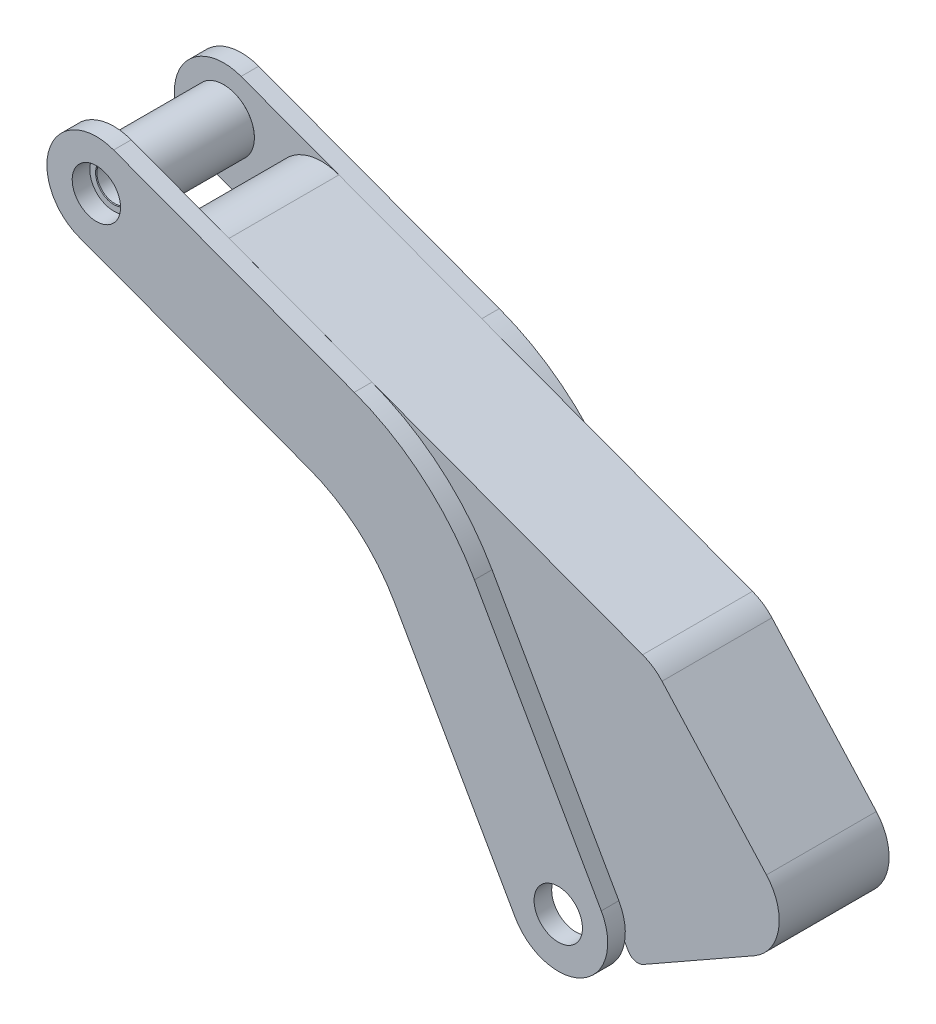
ISO-10303-21;
HEADER;
FILE_DESCRIPTION(('STEP AP214'),'2;1');
FILE_NAME('part.step','',(''),(''),'','','');
FILE_SCHEMA(('AUTOMOTIVE_DESIGN { 1 0 10303 214 1 1 1 1 }'));
ENDSEC;
DATA;
#1=APPLICATION_CONTEXT('core data for automotive mechanical design processes');
#2=APPLICATION_PROTOCOL_DEFINITION('international standard','automotive_design',2000,#1);
#3=PRODUCT_CONTEXT('',#1,'mechanical');
#4=PRODUCT('Part','Part','',(#3));
#5=PRODUCT_RELATED_PRODUCT_CATEGORY('part','',(#4));
#6=PRODUCT_DEFINITION_FORMATION('','',#4);
#7=PRODUCT_DEFINITION_CONTEXT('part definition',#1,'design');
#8=PRODUCT_DEFINITION('design','',#6,#7);
#9=PRODUCT_DEFINITION_SHAPE('','',#8);
#10=(LENGTH_UNIT() NAMED_UNIT(*) SI_UNIT(.MILLI.,.METRE.));
#11=(NAMED_UNIT(*) PLANE_ANGLE_UNIT() SI_UNIT($,.RADIAN.));
#12=(NAMED_UNIT(*) SI_UNIT($,.STERADIAN.) SOLID_ANGLE_UNIT());
#13=UNCERTAINTY_MEASURE_WITH_UNIT(LENGTH_MEASURE(1.E-05),#10,'distance_accuracy_value','');
#14=(GEOMETRIC_REPRESENTATION_CONTEXT(3) GLOBAL_UNCERTAINTY_ASSIGNED_CONTEXT((#13)) GLOBAL_UNIT_ASSIGNED_CONTEXT((#10,
#11,#12)) REPRESENTATION_CONTEXT('',''));
#15=CARTESIAN_POINT('',(0.,0.,0.));
#16=DIRECTION('',(0.,0.,1.));
#17=DIRECTION('',(1.,0.,0.));
#18=AXIS2_PLACEMENT_3D('',#15,#16,#17);
#19=CARTESIAN_POINT('',(38.8448601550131,-118.402276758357,-32.9999999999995));
#20=DIRECTION('',(0.,0.,1.));
#21=DIRECTION('',(0.761487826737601,-0.648179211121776,0.));
#22=AXIS2_PLACEMENT_3D('',#19,#20,#21);
#23=CYLINDRICAL_SURFACE('',#22,22.5);
#24=DIRECTION('',(0.,0.,1.));
#25=VECTOR('',#24,1.);
#26=CARTESIAN_POINT('',(31.0003466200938,-139.490510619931,-32.9999999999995));
#27=LINE('',#26,#25);
#28=CARTESIAN_POINT('',(31.0003466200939,-139.490510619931,-32.9999999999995));
#29=VERTEX_POINT('',#28);
#30=CARTESIAN_POINT('',(31.0003466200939,-139.490510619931,-24.9999999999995));
#31=VERTEX_POINT('',#30);
#32=EDGE_CURVE('P0_E155',#29,#31,#27,.T.);
#33=ORIENTED_EDGE('',*,*,#32,.T.);
#34=CARTESIAN_POINT('',(38.8448601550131,-118.402276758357,-24.9999999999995));
#35=DIRECTION('',(0.,0.,1.));
#36=DIRECTION('',(0.761487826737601,-0.648179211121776,0.));
#37=AXIS2_PLACEMENT_3D('',#34,#35,#36);
#38=CIRCLE('',#37,22.5);
#39=CARTESIAN_POINT('',(46.6893736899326,-97.3140428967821,-24.9999999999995));
#40=VERTEX_POINT('',#39);
#41=EDGE_CURVE('P0_E131',#40,#31,#38,.T.);
#42=ORIENTED_EDGE('',*,*,#41,.F.);
#43=DIRECTION('',(0.,0.,1.));
#44=VECTOR('',#43,1.);
#45=CARTESIAN_POINT('',(46.6893736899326,-97.3140428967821,-32.9999999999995));
#46=LINE('',#45,#44);
#47=CARTESIAN_POINT('',(46.6893736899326,-97.3140428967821,-32.9999999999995));
#48=VERTEX_POINT('',#47);
#49=EDGE_CURVE('P0_E108',#48,#40,#46,.T.);
#50=ORIENTED_EDGE('',*,*,#49,.F.);
#51=CARTESIAN_POINT('',(38.8448601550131,-118.402276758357,-32.9999999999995));
#52=DIRECTION('',(0.,0.,1.));
#53=DIRECTION('',(0.761487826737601,-0.648179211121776,0.));
#54=AXIS2_PLACEMENT_3D('',#51,#52,#53);
#55=CIRCLE('',#54,22.5);
#56=EDGE_CURVE('P0_E143',#48,#29,#55,.T.);
#57=ORIENTED_EDGE('',*,*,#56,.T.);
#58=EDGE_LOOP('',(#33,#42,#50,#57));
#59=FACE_BOUND('',#58,.T.);
#60=ADVANCED_FACE('P0_F34',(#59),#23,.T.);
#61=CARTESIAN_POINT('',(46.6893736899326,-97.3140428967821,-32.9999999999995));
#62=DIRECTION('',(0.348645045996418,0.937254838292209,0.));
#63=DIRECTION('',(-0.937254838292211,0.348645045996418,0.));
#64=AXIS2_PLACEMENT_3D('',#61,#62,#63);
#65=PLANE('',#64);
#66=DIRECTION('',(-0.937254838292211,0.348645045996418,0.));
#67=VECTOR('',#66,1.);
#68=CARTESIAN_POINT('',(192.006858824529,-151.370014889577,-24.9999999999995));
#69=LINE('',#68,#67);
#70=CARTESIAN_POINT('',(156.187908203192,-138.045890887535,-24.9999999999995));
#71=VERTEX_POINT('',#70);
#72=EDGE_CURVE('P0_E117',#71,#40,#69,.T.);
#73=ORIENTED_EDGE('',*,*,#72,.F.);
#74=DIRECTION('',(0.,0.,1.));
#75=VECTOR('',#74,1.);
#76=CARTESIAN_POINT('',(156.187908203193,-138.045890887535,-32.9999999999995));
#77=LINE('',#76,#75);
#78=CARTESIAN_POINT('',(156.187908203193,-138.045890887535,-32.9999999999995));
#79=VERTEX_POINT('',#78);
#80=EDGE_CURVE('P0_E163',#71,#79,#77,.F.);
#81=ORIENTED_EDGE('',*,*,#80,.T.);
#82=DIRECTION('',(-0.937254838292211,0.348645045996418,0.));
#83=VECTOR('',#82,1.);
#84=CARTESIAN_POINT('',(46.6893736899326,-97.3140428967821,-32.9999999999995));
#85=LINE('',#84,#83);
#86=EDGE_CURVE('P0_E153',#79,#48,#85,.T.);
#87=ORIENTED_EDGE('',*,*,#86,.T.);
#88=ORIENTED_EDGE('',*,*,#49,.T.);
#89=EDGE_LOOP('',(#73,#81,#87,#88));
#90=FACE_BOUND('',#89,.T.);
#91=ADVANCED_FACE('P0_F193',(#90),#65,.T.);
#92=CARTESIAN_POINT('',(192.006858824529,-151.370014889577,-32.9999999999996));
#93=DIRECTION('',(0.869533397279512,0.493874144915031,0.));
#94=DIRECTION('',(-0.493874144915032,0.869533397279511,0.));
#95=AXIS2_PLACEMENT_3D('',#92,#93,#94);
#96=PLANE('',#95);
#97=DIRECTION('',(-0.493874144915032,0.869533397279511,0.));
#98=VECTOR('',#97,1.);
#99=CARTESIAN_POINT('',(192.006858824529,-151.370014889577,-32.9999999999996));
#100=LINE('',#99,#98);
#101=CARTESIAN_POINT('',(268.58000177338,-286.187570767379,-32.9999999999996));
#102=VERTEX_POINT('',#101);
#103=CARTESIAN_POINT('',(210.881185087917,-184.600863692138,-32.9999999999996));
#104=VERTEX_POINT('',#103);
#105=EDGE_CURVE('P0_E151',#102,#104,#100,.T.);
#106=ORIENTED_EDGE('',*,*,#105,.T.);
#107=DIRECTION('',(0.,0.,1.));
#108=VECTOR('',#107,1.);
#109=CARTESIAN_POINT('',(210.881185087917,-184.600863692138,-32.9999999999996));
#110=LINE('',#109,#108);
#111=CARTESIAN_POINT('',(210.881185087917,-184.600863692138,-24.9999999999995));
#112=VERTEX_POINT('',#111);
#113=EDGE_CURVE('P0_E116',#104,#112,#110,.T.);
#114=ORIENTED_EDGE('',*,*,#113,.T.);
#115=DIRECTION('',(-0.493874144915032,0.869533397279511,0.));
#116=VECTOR('',#115,1.);
#117=CARTESIAN_POINT('',(268.58000177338,-286.187570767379,-24.9999999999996));
#118=LINE('',#117,#116);
#119=CARTESIAN_POINT('',(268.58000177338,-286.187570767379,-24.9999999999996));
#120=VERTEX_POINT('',#119);
#121=EDGE_CURVE('P0_E113',#120,#112,#118,.T.);
#122=ORIENTED_EDGE('',*,*,#121,.F.);
#123=DIRECTION('',(0.,0.,1.));
#124=VECTOR('',#123,1.);
#125=CARTESIAN_POINT('',(268.58000177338,-286.187570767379,-32.9999999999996));
#126=LINE('',#125,#124);
#127=EDGE_CURVE('P0_E97',#102,#120,#126,.T.);
#128=ORIENTED_EDGE('',*,*,#127,.F.);
#129=EDGE_LOOP('',(#106,#114,#122,#128));
#130=FACE_BOUND('',#129,.T.);
#131=ADVANCED_FACE('P0_F114',(#130),#96,.T.);
#132=CARTESIAN_POINT('',(249.015500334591,-297.299739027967,-32.9999999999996));
#133=DIRECTION('',(0.,0.,1.));
#134=DIRECTION('',(0.761487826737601,-0.648179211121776,0.));
#135=AXIS2_PLACEMENT_3D('',#132,#133,#134);
#136=CYLINDRICAL_SURFACE('',#135,22.5);
#137=ORIENTED_EDGE('',*,*,#127,.T.);
#138=CARTESIAN_POINT('',(249.015500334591,-297.299739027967,-24.9999999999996));
#139=DIRECTION('',(0.,0.,1.));
#140=DIRECTION('',(0.761487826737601,-0.648179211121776,0.));
#141=AXIS2_PLACEMENT_3D('',#138,#139,#140);
#142=CIRCLE('',#141,22.5);
#143=CARTESIAN_POINT('',(229.450998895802,-308.411907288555,-24.9999999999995));
#144=VERTEX_POINT('',#143);
#145=EDGE_CURVE('P0_E102',#144,#120,#142,.T.);
#146=ORIENTED_EDGE('',*,*,#145,.F.);
#147=DIRECTION('',(0.,0.,1.));
#148=VECTOR('',#147,1.);
#149=CARTESIAN_POINT('',(229.450998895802,-308.411907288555,-32.9999999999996));
#150=LINE('',#149,#148);
#151=CARTESIAN_POINT('',(229.450998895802,-308.411907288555,-32.9999999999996));
#152=VERTEX_POINT('',#151);
#153=EDGE_CURVE('P0_E109',#152,#144,#150,.T.);
#154=ORIENTED_EDGE('',*,*,#153,.F.);
#155=CARTESIAN_POINT('',(249.015500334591,-297.299739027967,-32.9999999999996));
#156=DIRECTION('',(0.,0.,1.));
#157=DIRECTION('',(0.761487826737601,-0.648179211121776,0.));
#158=AXIS2_PLACEMENT_3D('',#155,#156,#157);
#159=CIRCLE('',#158,22.5);
#160=EDGE_CURVE('P0_E104',#152,#102,#159,.T.);
#161=ORIENTED_EDGE('',*,*,#160,.T.);
#162=EDGE_LOOP('',(#137,#146,#154,#161));
#163=FACE_BOUND('',#162,.T.);
#164=ADVANCED_FACE('P0_F99',(#163),#136,.T.);
#165=CARTESIAN_POINT('',(160.966852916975,-187.836143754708,-32.9999999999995));
#166=DIRECTION('',(-0.869533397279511,-0.493874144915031,0.));
#167=DIRECTION('',(0.493874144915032,-0.869533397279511,0.));
#168=AXIS2_PLACEMENT_3D('',#165,#166,#167);
#169=PLANE('',#168);
#170=DIRECTION('',(0.493874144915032,-0.86953339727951,0.));
#171=VECTOR('',#170,1.);
#172=CARTESIAN_POINT('',(160.966852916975,-187.836143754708,-24.9999999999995));
#173=LINE('',#172,#171);
#174=CARTESIAN_POINT('',(174.44851453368,-211.572464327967,-24.9999999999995));
#175=VERTEX_POINT('',#174);
#176=EDGE_CURVE('P0_E121',#175,#144,#173,.T.);
#177=ORIENTED_EDGE('',*,*,#176,.F.);
#178=DIRECTION('',(0.,0.,1.));
#179=VECTOR('',#178,1.);
#180=CARTESIAN_POINT('',(174.44851453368,-211.572464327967,-32.9999999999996));
#181=LINE('',#180,#179);
#182=CARTESIAN_POINT('',(174.44851453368,-211.572464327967,-32.9999999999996));
#183=VERTEX_POINT('',#182);
#184=EDGE_CURVE('P0_E49',#175,#183,#181,.F.);
#185=ORIENTED_EDGE('',*,*,#184,.T.);
#186=DIRECTION('',(0.493874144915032,-0.86953339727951,0.));
#187=VECTOR('',#186,1.);
#188=CARTESIAN_POINT('',(160.966852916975,-187.836143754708,-32.9999999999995));
#189=LINE('',#188,#187);
#190=EDGE_CURVE('P0_E148',#183,#152,#189,.T.);
#191=ORIENTED_EDGE('',*,*,#190,.T.);
#192=ORIENTED_EDGE('',*,*,#153,.T.);
#193=EDGE_LOOP('',(#177,#185,#191,#192));
#194=FACE_BOUND('',#193,.T.);
#195=ADVANCED_FACE('P0_F213',(#194),#169,.T.);
#196=CARTESIAN_POINT('',(31.0003466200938,-139.490510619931,-32.9999999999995));
#197=DIRECTION('',(-0.348645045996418,-0.937254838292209,0.));
#198=DIRECTION('',(0.937254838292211,-0.348645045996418,0.));
#199=AXIS2_PLACEMENT_3D('',#196,#197,#198);
#200=PLANE('',#199);
#201=DIRECTION('',(0.937254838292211,-0.348645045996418,0.));
#202=VECTOR('',#201,1.);
#203=CARTESIAN_POINT('',(31.0003466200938,-139.490510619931,-32.9999999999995));
#204=LINE('',#203,#202);
#205=CARTESIAN_POINT('',(135.381888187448,-178.318912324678,-32.9999999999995));
#206=VERTEX_POINT('',#205);
#207=EDGE_CURVE('P0_E145',#29,#206,#204,.T.);
#208=ORIENTED_EDGE('',*,*,#207,.T.);
#209=DIRECTION('',(0.,0.,1.));
#210=VECTOR('',#209,1.);
#211=CARTESIAN_POINT('',(135.381888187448,-178.318912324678,-24.9999999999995));
#212=LINE('',#211,#210);
#213=CARTESIAN_POINT('',(135.381888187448,-178.318912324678,-24.9999999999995));
#214=VERTEX_POINT('',#213);
#215=EDGE_CURVE('P0_E167',#206,#214,#212,.T.);
#216=ORIENTED_EDGE('',*,*,#215,.T.);
#217=DIRECTION('',(0.937254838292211,-0.348645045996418,0.));
#218=VECTOR('',#217,1.);
#219=CARTESIAN_POINT('',(31.0003466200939,-139.490510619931,-24.9999999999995));
#220=LINE('',#219,#218);
#221=EDGE_CURVE('P0_E134',#31,#214,#220,.T.);
#222=ORIENTED_EDGE('',*,*,#221,.F.);
#223=ORIENTED_EDGE('',*,*,#32,.F.);
#224=EDGE_LOOP('',(#208,#216,#222,#223));
#225=FACE_BOUND('',#224,.T.);
#226=ADVANCED_FACE('P0_F173',(#225),#200,.T.);
#227=CARTESIAN_POINT('',(249.015500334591,-297.299739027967,-32.9999999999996));
#228=DIRECTION('',(0.,0.,1.));
#229=DIRECTION('',(0.761487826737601,-0.648179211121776,0.));
#230=AXIS2_PLACEMENT_3D('',#227,#228,#229);
#231=PLANE('',#230);
#232=CARTESIAN_POINT('',(249.015500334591,-297.299739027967,-32.9999999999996));
#233=DIRECTION('',(0.,0.,1.));
#234=DIRECTION('',(0.761487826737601,-0.648179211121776,0.));
#235=AXIS2_PLACEMENT_3D('',#232,#233,#234);
#236=CIRCLE('',#235,11.);
#237=CARTESIAN_POINT('',(257.391866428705,-304.429710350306,-32.9999999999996));
#238=VERTEX_POINT('',#237);
#239=EDGE_CURVE('P0_E137',#238,#238,#236,.T.);
#240=ORIENTED_EDGE('',*,*,#239,.T.);
#241=EDGE_LOOP('',(#240));
#242=FACE_BOUND('',#241,.T.);
#243=CARTESIAN_POINT('',(38.8448601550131,-118.402276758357,-32.9999999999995));
#244=DIRECTION('',(0.,0.,1.));
#245=DIRECTION('',(0.761487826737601,-0.648179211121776,0.));
#246=AXIS2_PLACEMENT_3D('',#243,#244,#245);
#247=CIRCLE('',#246,11.);
#248=CARTESIAN_POINT('',(47.2212262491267,-125.532248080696,-32.9999999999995));
#249=VERTEX_POINT('',#248);
#250=EDGE_CURVE('P0_E140',#249,#249,#247,.T.);
#251=ORIENTED_EDGE('',*,*,#250,.T.);
#252=EDGE_LOOP('',(#251));
#253=FACE_BOUND('',#252,.T.);
#254=ORIENTED_EDGE('',*,*,#86,.F.);
#255=CARTESIAN_POINT('',(119.580178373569,-236.457648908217,-32.9999999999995));
#256=DIRECTION('',(0.,0.,1.));
#257=DIRECTION('',(0.761487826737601,-0.648179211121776,0.));
#258=AXIS2_PLACEMENT_3D('',#255,#256,#257);
#259=CIRCLE('',#258,105.);
#260=EDGE_CURVE('P0_E165',#79,#104,#259,.F.);
#261=ORIENTED_EDGE('',*,*,#260,.T.);
#262=ORIENTED_EDGE('',*,*,#105,.F.);
#263=ORIENTED_EDGE('',*,*,#160,.F.);
#264=ORIENTED_EDGE('',*,*,#190,.F.);
#265=CARTESIAN_POINT('',(109.233509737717,-248.613025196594,-32.9999999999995));
#266=DIRECTION('',(0.,0.,1.));
#267=DIRECTION('',(0.761487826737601,-0.648179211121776,0.));
#268=AXIS2_PLACEMENT_3D('',#265,#266,#267);
#269=CIRCLE('',#268,75.);
#270=EDGE_CURVE('P0_E11',#183,#206,#269,.T.);
#271=ORIENTED_EDGE('',*,*,#270,.T.);
#272=ORIENTED_EDGE('',*,*,#207,.F.);
#273=ORIENTED_EDGE('',*,*,#56,.F.);
#274=EDGE_LOOP('',(#254,#261,#262,#263,#264,#271,#272,#273));
#275=FACE_BOUND('',#274,.T.);
#276=ADVANCED_FACE('P0_F185',(#242,#253,#275),#231,.F.);
#277=CARTESIAN_POINT('',(38.8448601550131,-118.402276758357,-28.9999999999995));
#278=DIRECTION('',(0.,0.,1.));
#279=DIRECTION('',(0.761487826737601,-0.648179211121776,0.));
#280=AXIS2_PLACEMENT_3D('',#277,#278,#279);
#281=CYLINDRICAL_SURFACE('',#280,11.);
#282=ORIENTED_EDGE('',*,*,#250,.F.);
#283=EDGE_LOOP('',(#282));
#284=FACE_BOUND('',#283,.T.);
#285=CARTESIAN_POINT('',(38.8448601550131,-118.402276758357,-24.9999999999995));
#286=DIRECTION('',(0.,0.,1.));
#287=DIRECTION('',(0.761487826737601,-0.648179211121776,0.));
#288=AXIS2_PLACEMENT_3D('',#285,#286,#287);
#289=CIRCLE('',#288,11.);
#290=CARTESIAN_POINT('',(47.2212262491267,-125.532248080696,-24.9999999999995));
#291=VERTEX_POINT('',#290);
#292=EDGE_CURVE('P0_E123',#291,#291,#289,.T.);
#293=ORIENTED_EDGE('',*,*,#292,.T.);
#294=EDGE_LOOP('',(#293));
#295=FACE_BOUND('',#294,.T.);
#296=ADVANCED_FACE('P0_F204',(#284,#295),#281,.F.);
#297=CARTESIAN_POINT('',(249.015500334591,-297.299739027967,-28.9999999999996));
#298=DIRECTION('',(0.,0.,1.));
#299=DIRECTION('',(0.761487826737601,-0.648179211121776,0.));
#300=AXIS2_PLACEMENT_3D('',#297,#298,#299);
#301=CYLINDRICAL_SURFACE('',#300,11.);
#302=ORIENTED_EDGE('',*,*,#239,.F.);
#303=EDGE_LOOP('',(#302));
#304=FACE_BOUND('',#303,.T.);
#305=CARTESIAN_POINT('',(249.015500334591,-297.299739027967,-24.9999999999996));
#306=DIRECTION('',(0.,0.,1.));
#307=DIRECTION('',(0.761487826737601,-0.648179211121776,0.));
#308=AXIS2_PLACEMENT_3D('',#305,#306,#307);
#309=CIRCLE('',#308,11.);
#310=CARTESIAN_POINT('',(257.391866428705,-304.429710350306,-24.9999999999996));
#311=VERTEX_POINT('',#310);
#312=EDGE_CURVE('P0_E126',#311,#311,#309,.T.);
#313=ORIENTED_EDGE('',*,*,#312,.T.);
#314=EDGE_LOOP('',(#313));
#315=FACE_BOUND('',#314,.T.);
#316=ADVANCED_FACE('P0_F210',(#304,#315),#301,.F.);
#317=CARTESIAN_POINT('',(249.015500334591,-297.299739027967,-24.9999999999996));
#318=DIRECTION('',(0.,0.,1.));
#319=DIRECTION('',(0.761487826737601,-0.648179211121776,0.));
#320=AXIS2_PLACEMENT_3D('',#317,#318,#319);
#321=PLANE('',#320);
#322=ORIENTED_EDGE('',*,*,#292,.F.);
#323=EDGE_LOOP('',(#322));
#324=FACE_BOUND('',#323,.T.);
#325=ORIENTED_EDGE('',*,*,#121,.T.);
#326=CARTESIAN_POINT('',(119.580178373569,-236.457648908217,-24.9999999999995));
#327=DIRECTION('',(0.,0.,1.));
#328=DIRECTION('',(0.761487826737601,-0.648179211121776,0.));
#329=AXIS2_PLACEMENT_3D('',#326,#327,#328);
#330=CIRCLE('',#329,105.);
#331=EDGE_CURVE('P0_E161',#112,#71,#330,.T.);
#332=ORIENTED_EDGE('',*,*,#331,.T.);
#333=ORIENTED_EDGE('',*,*,#72,.T.);
#334=ORIENTED_EDGE('',*,*,#41,.T.);
#335=ORIENTED_EDGE('',*,*,#221,.T.);
#336=CARTESIAN_POINT('',(109.233509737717,-248.613025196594,-24.9999999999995));
#337=DIRECTION('',(0.,0.,1.));
#338=DIRECTION('',(0.761487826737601,-0.648179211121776,0.));
#339=AXIS2_PLACEMENT_3D('',#336,#337,#338);
#340=CIRCLE('',#339,75.);
#341=EDGE_CURVE('P0_E42',#214,#175,#340,.F.);
#342=ORIENTED_EDGE('',*,*,#341,.T.);
#343=ORIENTED_EDGE('',*,*,#176,.T.);
#344=ORIENTED_EDGE('',*,*,#145,.T.);
#345=EDGE_LOOP('',(#325,#332,#333,#334,#335,#342,#343,#344));
#346=FACE_BOUND('',#345,.T.);
#347=ORIENTED_EDGE('',*,*,#312,.F.);
#348=EDGE_LOOP('',(#347));
#349=FACE_BOUND('',#348,.T.);
#350=ADVANCED_FACE('P0_F119',(#324,#346,#349),#321,.T.);
#351=CARTESIAN_POINT('',(119.580178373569,-236.457648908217,-32.9999999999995));
#352=DIRECTION('',(0.,0.,1.));
#353=DIRECTION('',(0.761487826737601,-0.648179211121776,0.));
#354=AXIS2_PLACEMENT_3D('',#351,#352,#353);
#355=CYLINDRICAL_SURFACE('',#354,105.);
#356=ORIENTED_EDGE('',*,*,#260,.F.);
#357=ORIENTED_EDGE('',*,*,#80,.F.);
#358=ORIENTED_EDGE('',*,*,#331,.F.);
#359=ORIENTED_EDGE('',*,*,#113,.F.);
#360=EDGE_LOOP('',(#356,#357,#358,#359));
#361=FACE_BOUND('',#360,.T.);
#362=ADVANCED_FACE('P0_F187',(#361),#355,.T.);
#363=CARTESIAN_POINT('',(109.233509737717,-248.613025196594,-32.9999999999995));
#364=DIRECTION('',(0.,0.,-1.));
#365=DIRECTION('',(-0.761487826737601,0.648179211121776,0.));
#366=AXIS2_PLACEMENT_3D('',#363,#364,#365);
#367=CYLINDRICAL_SURFACE('',#366,75.);
#368=ORIENTED_EDGE('',*,*,#270,.F.);
#369=ORIENTED_EDGE('',*,*,#184,.F.);
#370=ORIENTED_EDGE('',*,*,#341,.F.);
#371=ORIENTED_EDGE('',*,*,#215,.F.);
#372=EDGE_LOOP('',(#368,#369,#370,#371));
#373=FACE_BOUND('',#372,.T.);
#374=ADVANCED_FACE('P0_F36',(#373),#367,.F.);
#375=CLOSED_SHELL('',(#60,#91,#131,#164,#195,#226,#276,#296,#316,#350,#362,#374));
#376=MANIFOLD_SOLID_BREP('P0_B2',#375);
#377=CARTESIAN_POINT('',(38.8448601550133,-118.402276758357,25.0000000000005));
#378=DIRECTION('',(0.,0.,1.));
#379=DIRECTION('',(0.7614878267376,-0.648179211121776,0.));
#380=AXIS2_PLACEMENT_3D('',#377,#378,#379);
#381=CYLINDRICAL_SURFACE('',#380,22.5);
#382=DIRECTION('',(0.,0.,1.));
#383=VECTOR('',#382,1.);
#384=CARTESIAN_POINT('',(31.0003466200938,-139.490510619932,25.0000000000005));
#385=LINE('',#384,#383);
#386=CARTESIAN_POINT('',(31.0003466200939,-139.490510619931,25.0000000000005));
#387=VERTEX_POINT('',#386);
#388=CARTESIAN_POINT('',(31.0003466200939,-139.490510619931,33.0000000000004));
#389=VERTEX_POINT('',#388);
#390=EDGE_CURVE('P1_E137',#387,#389,#385,.T.);
#391=ORIENTED_EDGE('',*,*,#390,.T.);
#392=CARTESIAN_POINT('',(38.8448601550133,-118.402276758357,33.0000000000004));
#393=DIRECTION('',(0.,0.,1.));
#394=DIRECTION('',(0.7614878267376,-0.648179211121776,0.));
#395=AXIS2_PLACEMENT_3D('',#392,#393,#394);
#396=CIRCLE('',#395,22.5);
#397=CARTESIAN_POINT('',(46.6893736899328,-97.3140428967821,33.0000000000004));
#398=VERTEX_POINT('',#397);
#399=EDGE_CURVE('P1_E113',#398,#389,#396,.T.);
#400=ORIENTED_EDGE('',*,*,#399,.F.);
#401=DIRECTION('',(0.,0.,1.));
#402=VECTOR('',#401,1.);
#403=CARTESIAN_POINT('',(46.6893736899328,-97.3140428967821,25.0000000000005));
#404=LINE('',#403,#402);
#405=CARTESIAN_POINT('',(46.6893736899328,-97.3140428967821,25.0000000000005));
#406=VERTEX_POINT('',#405);
#407=EDGE_CURVE('P1_E90',#406,#398,#404,.T.);
#408=ORIENTED_EDGE('',*,*,#407,.F.);
#409=CARTESIAN_POINT('',(38.8448601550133,-118.402276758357,25.0000000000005));
#410=DIRECTION('',(0.,0.,1.));
#411=DIRECTION('',(0.7614878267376,-0.648179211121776,0.));
#412=AXIS2_PLACEMENT_3D('',#409,#410,#411);
#413=CIRCLE('',#412,22.5);
#414=EDGE_CURVE('P1_E125',#406,#387,#413,.T.);
#415=ORIENTED_EDGE('',*,*,#414,.T.);
#416=EDGE_LOOP('',(#391,#400,#408,#415));
#417=FACE_BOUND('',#416,.T.);
#418=ADVANCED_FACE('P1_F16',(#417),#381,.T.);
#419=CARTESIAN_POINT('',(46.6893736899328,-97.3140428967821,25.0000000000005));
#420=DIRECTION('',(0.348645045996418,0.937254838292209,0.));
#421=DIRECTION('',(-0.937254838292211,0.348645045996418,0.));
#422=AXIS2_PLACEMENT_3D('',#419,#420,#421);
#423=PLANE('',#422);
#424=DIRECTION('',(-0.937254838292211,0.348645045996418,0.));
#425=VECTOR('',#424,1.);
#426=CARTESIAN_POINT('',(192.006858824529,-151.370014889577,33.0000000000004));
#427=LINE('',#426,#425);
#428=CARTESIAN_POINT('',(156.187908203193,-138.045890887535,33.0000000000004));
#429=VERTEX_POINT('',#428);
#430=EDGE_CURVE('P1_E99',#429,#398,#427,.T.);
#431=ORIENTED_EDGE('',*,*,#430,.F.);
#432=DIRECTION('',(0.,0.,1.));
#433=VECTOR('',#432,1.);
#434=CARTESIAN_POINT('',(156.187908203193,-138.045890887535,25.0000000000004));
#435=LINE('',#434,#433);
#436=CARTESIAN_POINT('',(156.187908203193,-138.045890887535,25.0000000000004));
#437=VERTEX_POINT('',#436);
#438=EDGE_CURVE('P1_E145',#429,#437,#435,.F.);
#439=ORIENTED_EDGE('',*,*,#438,.T.);
#440=DIRECTION('',(-0.937254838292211,0.348645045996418,0.));
#441=VECTOR('',#440,1.);
#442=CARTESIAN_POINT('',(46.6893736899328,-97.3140428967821,25.0000000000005));
#443=LINE('',#442,#441);
#444=EDGE_CURVE('P1_E135',#437,#406,#443,.T.);
#445=ORIENTED_EDGE('',*,*,#444,.T.);
#446=ORIENTED_EDGE('',*,*,#407,.T.);
#447=EDGE_LOOP('',(#431,#439,#445,#446));
#448=FACE_BOUND('',#447,.T.);
#449=ADVANCED_FACE('P1_F176',(#448),#423,.T.);
#450=CARTESIAN_POINT('',(192.006858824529,-151.370014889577,25.0000000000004));
#451=DIRECTION('',(0.869533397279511,0.493874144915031,0.));
#452=DIRECTION('',(-0.493874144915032,0.869533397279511,0.));
#453=AXIS2_PLACEMENT_3D('',#450,#451,#452);
#454=PLANE('',#453);
#455=DIRECTION('',(-0.493874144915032,0.869533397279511,0.));
#456=VECTOR('',#455,1.);
#457=CARTESIAN_POINT('',(192.006858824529,-151.370014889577,25.0000000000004));
#458=LINE('',#457,#456);
#459=CARTESIAN_POINT('',(268.58000177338,-286.187570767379,25.0000000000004));
#460=VERTEX_POINT('',#459);
#461=CARTESIAN_POINT('',(210.881185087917,-184.600863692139,25.0000000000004));
#462=VERTEX_POINT('',#461);
#463=EDGE_CURVE('P1_E133',#460,#462,#458,.T.);
#464=ORIENTED_EDGE('',*,*,#463,.T.);
#465=DIRECTION('',(0.,0.,1.));
#466=VECTOR('',#465,1.);
#467=CARTESIAN_POINT('',(210.881185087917,-184.600863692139,25.0000000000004));
#468=LINE('',#467,#466);
#469=CARTESIAN_POINT('',(210.881185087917,-184.600863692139,33.0000000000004));
#470=VERTEX_POINT('',#469);
#471=EDGE_CURVE('P1_E98',#462,#470,#468,.T.);
#472=ORIENTED_EDGE('',*,*,#471,.T.);
#473=DIRECTION('',(-0.493874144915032,0.86953339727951,0.));
#474=VECTOR('',#473,1.);
#475=CARTESIAN_POINT('',(268.58000177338,-286.187570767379,33.0000000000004));
#476=LINE('',#475,#474);
#477=CARTESIAN_POINT('',(268.58000177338,-286.187570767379,33.0000000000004));
#478=VERTEX_POINT('',#477);
#479=EDGE_CURVE('P1_E95',#478,#470,#476,.T.);
#480=ORIENTED_EDGE('',*,*,#479,.F.);
#481=DIRECTION('',(0.,0.,1.));
#482=VECTOR('',#481,1.);
#483=CARTESIAN_POINT('',(268.58000177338,-286.187570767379,25.0000000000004));
#484=LINE('',#483,#482);
#485=EDGE_CURVE('P1_E79',#460,#478,#484,.T.);
#486=ORIENTED_EDGE('',*,*,#485,.F.);
#487=EDGE_LOOP('',(#464,#472,#480,#486));
#488=FACE_BOUND('',#487,.T.);
#489=ADVANCED_FACE('P1_F96',(#488),#454,.T.);
#490=CARTESIAN_POINT('',(249.015500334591,-297.299739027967,25.0000000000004));
#491=DIRECTION('',(0.,0.,1.));
#492=DIRECTION('',(0.7614878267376,-0.648179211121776,0.));
#493=AXIS2_PLACEMENT_3D('',#490,#491,#492);
#494=CYLINDRICAL_SURFACE('',#493,22.5);
#495=ORIENTED_EDGE('',*,*,#485,.T.);
#496=CARTESIAN_POINT('',(249.015500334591,-297.299739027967,33.0000000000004));
#497=DIRECTION('',(0.,0.,1.));
#498=DIRECTION('',(0.7614878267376,-0.648179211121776,0.));
#499=AXIS2_PLACEMENT_3D('',#496,#497,#498);
#500=CIRCLE('',#499,22.5);
#501=CARTESIAN_POINT('',(229.450998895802,-308.411907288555,33.0000000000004));
#502=VERTEX_POINT('',#501);
#503=EDGE_CURVE('P1_E84',#502,#478,#500,.T.);
#504=ORIENTED_EDGE('',*,*,#503,.F.);
#505=DIRECTION('',(0.,0.,1.));
#506=VECTOR('',#505,1.);
#507=CARTESIAN_POINT('',(229.450998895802,-308.411907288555,25.0000000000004));
#508=LINE('',#507,#506);
#509=CARTESIAN_POINT('',(229.450998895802,-308.411907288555,25.0000000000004));
#510=VERTEX_POINT('',#509);
#511=EDGE_CURVE('P1_E91',#510,#502,#508,.T.);
#512=ORIENTED_EDGE('',*,*,#511,.F.);
#513=CARTESIAN_POINT('',(249.015500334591,-297.299739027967,25.0000000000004));
#514=DIRECTION('',(0.,0.,1.));
#515=DIRECTION('',(0.7614878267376,-0.648179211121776,0.));
#516=AXIS2_PLACEMENT_3D('',#513,#514,#515);
#517=CIRCLE('',#516,22.5);
#518=EDGE_CURVE('P1_E86',#510,#460,#517,.T.);
#519=ORIENTED_EDGE('',*,*,#518,.T.);
#520=EDGE_LOOP('',(#495,#504,#512,#519));
#521=FACE_BOUND('',#520,.T.);
#522=ADVANCED_FACE('P1_F81',(#521),#494,.T.);
#523=CARTESIAN_POINT('',(160.966852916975,-187.836143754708,25.0000000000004));
#524=DIRECTION('',(-0.869533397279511,-0.493874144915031,0.));
#525=DIRECTION('',(0.493874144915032,-0.869533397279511,0.));
#526=AXIS2_PLACEMENT_3D('',#523,#524,#525);
#527=PLANE('',#526);
#528=DIRECTION('',(0.493874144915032,-0.86953339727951,0.));
#529=VECTOR('',#528,1.);
#530=CARTESIAN_POINT('',(160.966852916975,-187.836143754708,33.0000000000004));
#531=LINE('',#530,#529);
#532=CARTESIAN_POINT('',(174.448514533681,-211.572464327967,33.0000000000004));
#533=VERTEX_POINT('',#532);
#534=EDGE_CURVE('P1_E103',#533,#502,#531,.T.);
#535=ORIENTED_EDGE('',*,*,#534,.F.);
#536=DIRECTION('',(0.,0.,1.));
#537=VECTOR('',#536,1.);
#538=CARTESIAN_POINT('',(174.448514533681,-211.572464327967,25.0000000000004));
#539=LINE('',#538,#537);
#540=CARTESIAN_POINT('',(174.448514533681,-211.572464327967,25.0000000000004));
#541=VERTEX_POINT('',#540);
#542=EDGE_CURVE('P1_E31',#533,#541,#539,.F.);
#543=ORIENTED_EDGE('',*,*,#542,.T.);
#544=DIRECTION('',(0.493874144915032,-0.86953339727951,0.));
#545=VECTOR('',#544,1.);
#546=CARTESIAN_POINT('',(160.966852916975,-187.836143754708,25.0000000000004));
#547=LINE('',#546,#545);
#548=EDGE_CURVE('P1_E130',#541,#510,#547,.T.);
#549=ORIENTED_EDGE('',*,*,#548,.T.);
#550=ORIENTED_EDGE('',*,*,#511,.T.);
#551=EDGE_LOOP('',(#535,#543,#549,#550));
#552=FACE_BOUND('',#551,.T.);
#553=ADVANCED_FACE('P1_F196',(#552),#527,.T.);
#554=CARTESIAN_POINT('',(31.0003466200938,-139.490510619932,25.0000000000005));
#555=DIRECTION('',(-0.348645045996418,-0.937254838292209,0.));
#556=DIRECTION('',(0.937254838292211,-0.348645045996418,0.));
#557=AXIS2_PLACEMENT_3D('',#554,#555,#556);
#558=PLANE('',#557);
#559=DIRECTION('',(0.937254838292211,-0.348645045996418,0.));
#560=VECTOR('',#559,1.);
#561=CARTESIAN_POINT('',(31.0003466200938,-139.490510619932,25.0000000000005));
#562=LINE('',#561,#560);
#563=CARTESIAN_POINT('',(135.381888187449,-178.318912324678,25.0000000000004));
#564=VERTEX_POINT('',#563);
#565=EDGE_CURVE('P1_E127',#387,#564,#562,.T.);
#566=ORIENTED_EDGE('',*,*,#565,.T.);
#567=DIRECTION('',(0.,0.,1.));
#568=VECTOR('',#567,1.);
#569=CARTESIAN_POINT('',(135.381888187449,-178.318912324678,33.0000000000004));
#570=LINE('',#569,#568);
#571=CARTESIAN_POINT('',(135.381888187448,-178.318912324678,33.0000000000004));
#572=VERTEX_POINT('',#571);
#573=EDGE_CURVE('P1_E149',#564,#572,#570,.T.);
#574=ORIENTED_EDGE('',*,*,#573,.T.);
#575=DIRECTION('',(0.937254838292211,-0.348645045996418,0.));
#576=VECTOR('',#575,1.);
#577=CARTESIAN_POINT('',(31.0003466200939,-139.490510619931,33.0000000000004));
#578=LINE('',#577,#576);
#579=EDGE_CURVE('P1_E116',#389,#572,#578,.T.);
#580=ORIENTED_EDGE('',*,*,#579,.F.);
#581=ORIENTED_EDGE('',*,*,#390,.F.);
#582=EDGE_LOOP('',(#566,#574,#580,#581));
#583=FACE_BOUND('',#582,.T.);
#584=ADVANCED_FACE('P1_F155',(#583),#558,.T.);
#585=CARTESIAN_POINT('',(249.015500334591,-297.299739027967,25.0000000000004));
#586=DIRECTION('',(0.,0.,1.));
#587=DIRECTION('',(0.7614878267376,-0.648179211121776,0.));
#588=AXIS2_PLACEMENT_3D('',#585,#586,#587);
#589=PLANE('',#588);
#590=CARTESIAN_POINT('',(249.015500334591,-297.299739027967,25.0000000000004));
#591=DIRECTION('',(0.,0.,1.));
#592=DIRECTION('',(0.7614878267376,-0.648179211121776,0.));
#593=AXIS2_PLACEMENT_3D('',#590,#591,#592);
#594=CIRCLE('',#593,11.);
#595=CARTESIAN_POINT('',(257.391866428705,-304.429710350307,25.0000000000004));
#596=VERTEX_POINT('',#595);
#597=EDGE_CURVE('P1_E119',#596,#596,#594,.T.);
#598=ORIENTED_EDGE('',*,*,#597,.T.);
#599=EDGE_LOOP('',(#598));
#600=FACE_BOUND('',#599,.T.);
#601=CARTESIAN_POINT('',(38.8448601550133,-118.402276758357,25.0000000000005));
#602=DIRECTION('',(0.,0.,1.));
#603=DIRECTION('',(0.7614878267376,-0.648179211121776,0.));
#604=AXIS2_PLACEMENT_3D('',#601,#602,#603);
#605=CIRCLE('',#604,11.);
#606=CARTESIAN_POINT('',(47.2212262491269,-125.532248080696,25.0000000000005));
#607=VERTEX_POINT('',#606);
#608=EDGE_CURVE('P1_E122',#607,#607,#605,.T.);
#609=ORIENTED_EDGE('',*,*,#608,.T.);
#610=EDGE_LOOP('',(#609));
#611=FACE_BOUND('',#610,.T.);
#612=ORIENTED_EDGE('',*,*,#444,.F.);
#613=CARTESIAN_POINT('',(119.580178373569,-236.457648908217,25.0000000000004));
#614=DIRECTION('',(0.,0.,1.));
#615=DIRECTION('',(0.7614878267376,-0.648179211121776,0.));
#616=AXIS2_PLACEMENT_3D('',#613,#614,#615);
#617=CIRCLE('',#616,105.);
#618=EDGE_CURVE('P1_E147',#437,#462,#617,.F.);
#619=ORIENTED_EDGE('',*,*,#618,.T.);
#620=ORIENTED_EDGE('',*,*,#463,.F.);
#621=ORIENTED_EDGE('',*,*,#518,.F.);
#622=ORIENTED_EDGE('',*,*,#548,.F.);
#623=CARTESIAN_POINT('',(109.233509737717,-248.613025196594,25.0000000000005));
#624=DIRECTION('',(0.,0.,1.));
#625=DIRECTION('',(0.7614878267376,-0.648179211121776,0.));
#626=AXIS2_PLACEMENT_3D('',#623,#624,#625);
#627=CIRCLE('',#626,75.);
#628=EDGE_CURVE('P1_E11',#541,#564,#627,.T.);
#629=ORIENTED_EDGE('',*,*,#628,.T.);
#630=ORIENTED_EDGE('',*,*,#565,.F.);
#631=ORIENTED_EDGE('',*,*,#414,.F.);
#632=EDGE_LOOP('',(#612,#619,#620,#621,#622,#629,#630,#631));
#633=FACE_BOUND('',#632,.T.);
#634=ADVANCED_FACE('P1_F167',(#600,#611,#633),#589,.F.);
#635=CARTESIAN_POINT('',(38.8448601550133,-118.402276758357,29.0000000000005));
#636=DIRECTION('',(0.,0.,1.));
#637=DIRECTION('',(0.7614878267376,-0.648179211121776,0.));
#638=AXIS2_PLACEMENT_3D('',#635,#636,#637);
#639=CYLINDRICAL_SURFACE('',#638,11.);
#640=ORIENTED_EDGE('',*,*,#608,.F.);
#641=EDGE_LOOP('',(#640));
#642=FACE_BOUND('',#641,.T.);
#643=CARTESIAN_POINT('',(38.8448601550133,-118.402276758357,33.0000000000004));
#644=DIRECTION('',(0.,0.,1.));
#645=DIRECTION('',(0.7614878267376,-0.648179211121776,0.));
#646=AXIS2_PLACEMENT_3D('',#643,#644,#645);
#647=CIRCLE('',#646,11.);
#648=CARTESIAN_POINT('',(47.2212262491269,-125.532248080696,33.0000000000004));
#649=VERTEX_POINT('',#648);
#650=EDGE_CURVE('P1_E105',#649,#649,#647,.T.);
#651=ORIENTED_EDGE('',*,*,#650,.T.);
#652=EDGE_LOOP('',(#651));
#653=FACE_BOUND('',#652,.T.);
#654=ADVANCED_FACE('P1_F187',(#642,#653),#639,.F.);
#655=CARTESIAN_POINT('',(249.015500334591,-297.299739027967,29.0000000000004));
#656=DIRECTION('',(0.,0.,1.));
#657=DIRECTION('',(0.7614878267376,-0.648179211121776,0.));
#658=AXIS2_PLACEMENT_3D('',#655,#656,#657);
#659=CYLINDRICAL_SURFACE('',#658,11.);
#660=ORIENTED_EDGE('',*,*,#597,.F.);
#661=EDGE_LOOP('',(#660));
#662=FACE_BOUND('',#661,.T.);
#663=CARTESIAN_POINT('',(249.015500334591,-297.299739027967,33.0000000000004));
#664=DIRECTION('',(0.,0.,1.));
#665=DIRECTION('',(0.7614878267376,-0.648179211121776,0.));
#666=AXIS2_PLACEMENT_3D('',#663,#664,#665);
#667=CIRCLE('',#666,11.);
#668=CARTESIAN_POINT('',(257.391866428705,-304.429710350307,33.0000000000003));
#669=VERTEX_POINT('',#668);
#670=EDGE_CURVE('P1_E108',#669,#669,#667,.T.);
#671=ORIENTED_EDGE('',*,*,#670,.T.);
#672=EDGE_LOOP('',(#671));
#673=FACE_BOUND('',#672,.T.);
#674=ADVANCED_FACE('P1_F193',(#662,#673),#659,.F.);
#675=CARTESIAN_POINT('',(249.015500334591,-297.299739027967,33.0000000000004));
#676=DIRECTION('',(0.,0.,1.));
#677=DIRECTION('',(0.7614878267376,-0.648179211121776,0.));
#678=AXIS2_PLACEMENT_3D('',#675,#676,#677);
#679=PLANE('',#678);
#680=ORIENTED_EDGE('',*,*,#650,.F.);
#681=EDGE_LOOP('',(#680));
#682=FACE_BOUND('',#681,.T.);
#683=ORIENTED_EDGE('',*,*,#479,.T.);
#684=CARTESIAN_POINT('',(119.580178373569,-236.457648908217,33.0000000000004));
#685=DIRECTION('',(0.,0.,1.));
#686=DIRECTION('',(0.7614878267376,-0.648179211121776,0.));
#687=AXIS2_PLACEMENT_3D('',#684,#685,#686);
#688=CIRCLE('',#687,105.);
#689=EDGE_CURVE('P1_E143',#470,#429,#688,.T.);
#690=ORIENTED_EDGE('',*,*,#689,.T.);
#691=ORIENTED_EDGE('',*,*,#430,.T.);
#692=ORIENTED_EDGE('',*,*,#399,.T.);
#693=ORIENTED_EDGE('',*,*,#579,.T.);
#694=CARTESIAN_POINT('',(109.233509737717,-248.613025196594,33.0000000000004));
#695=DIRECTION('',(0.,0.,1.));
#696=DIRECTION('',(0.7614878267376,-0.648179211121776,0.));
#697=AXIS2_PLACEMENT_3D('',#694,#695,#696);
#698=CIRCLE('',#697,75.);
#699=EDGE_CURVE('P1_E24',#572,#533,#698,.F.);
#700=ORIENTED_EDGE('',*,*,#699,.T.);
#701=ORIENTED_EDGE('',*,*,#534,.T.);
#702=ORIENTED_EDGE('',*,*,#503,.T.);
#703=EDGE_LOOP('',(#683,#690,#691,#692,#693,#700,#701,#702));
#704=FACE_BOUND('',#703,.T.);
#705=ORIENTED_EDGE('',*,*,#670,.F.);
#706=EDGE_LOOP('',(#705));
#707=FACE_BOUND('',#706,.T.);
#708=ADVANCED_FACE('P1_F101',(#682,#704,#707),#679,.T.);
#709=CARTESIAN_POINT('',(119.580178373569,-236.457648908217,25.0000000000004));
#710=DIRECTION('',(0.,0.,1.));
#711=DIRECTION('',(0.7614878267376,-0.648179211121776,0.));
#712=AXIS2_PLACEMENT_3D('',#709,#710,#711);
#713=CYLINDRICAL_SURFACE('',#712,105.);
#714=ORIENTED_EDGE('',*,*,#618,.F.);
#715=ORIENTED_EDGE('',*,*,#438,.F.);
#716=ORIENTED_EDGE('',*,*,#689,.F.);
#717=ORIENTED_EDGE('',*,*,#471,.F.);
#718=EDGE_LOOP('',(#714,#715,#716,#717));
#719=FACE_BOUND('',#718,.T.);
#720=ADVANCED_FACE('P1_F169',(#719),#713,.T.);
#721=CARTESIAN_POINT('',(109.233509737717,-248.613025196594,25.0000000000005));
#722=DIRECTION('',(0.,0.,-1.));
#723=DIRECTION('',(-0.7614878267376,0.648179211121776,0.));
#724=AXIS2_PLACEMENT_3D('',#721,#722,#723);
#725=CYLINDRICAL_SURFACE('',#724,75.);
#726=ORIENTED_EDGE('',*,*,#628,.F.);
#727=ORIENTED_EDGE('',*,*,#542,.F.);
#728=ORIENTED_EDGE('',*,*,#699,.F.);
#729=ORIENTED_EDGE('',*,*,#573,.F.);
#730=EDGE_LOOP('',(#726,#727,#728,#729));
#731=FACE_BOUND('',#730,.T.);
#732=ADVANCED_FACE('P1_F18',(#731),#725,.F.);
#733=CLOSED_SHELL('',(#418,#449,#489,#522,#553,#584,#634,#654,#674,#708,#720,#732));
#734=MANIFOLD_SOLID_BREP('P1_B1',#733);
#735=CARTESIAN_POINT('',(109.221533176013,-248.591938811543,-24.9999999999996));
#736=DIRECTION('',(0.,0.,-1.));
#737=DIRECTION('',(-0.76144886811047,0.648224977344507,0.));
#738=AXIS2_PLACEMENT_3D('',#735,#736,#737);
#739=PLANE('',#738);
#740=DIRECTION('',(-0.869533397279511,-0.493874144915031,0.));
#741=VECTOR('',#740,1.);
#742=CARTESIAN_POINT('',(240.372702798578,-282.082904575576,-24.9999999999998));
#743=LINE('',#742,#741);
#744=CARTESIAN_POINT('',(240.372702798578,-282.082904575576,-24.9999999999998));
#745=VERTEX_POINT('',#744);
#746=CARTESIAN_POINT('',(225.155868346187,-290.725702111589,-24.9999999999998));
#747=VERTEX_POINT('',#746);
#748=EDGE_CURVE('P2_E135',#745,#747,#743,.T.);
#749=ORIENTED_EDGE('',*,*,#748,.T.);
#750=CARTESIAN_POINT('',(222.686497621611,-286.378035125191,-24.9999999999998));
#751=DIRECTION('',(0.,0.,-1.));
#752=DIRECTION('',(-0.76144886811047,0.648224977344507,0.));
#753=AXIS2_PLACEMENT_3D('',#750,#751,#752);
#754=CIRCLE('',#753,5.);
#755=CARTESIAN_POINT('',(218.338830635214,-288.847405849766,-24.9999999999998));
#756=VERTEX_POINT('',#755);
#757=EDGE_CURVE('P2_E229',#747,#756,#754,.T.);
#758=ORIENTED_EDGE('',*,*,#757,.T.);
#759=DIRECTION('',(-0.493874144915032,0.86953339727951,0.));
#760=VECTOR('',#759,1.);
#761=CARTESIAN_POINT('',(229.450998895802,-308.411907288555,-24.9999999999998));
#762=LINE('',#761,#760);
#763=CARTESIAN_POINT('',(174.436537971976,-211.551377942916,-24.9999999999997));
#764=VERTEX_POINT('',#763);
#765=EDGE_CURVE('P2_E171',#756,#764,#762,.T.);
#766=ORIENTED_EDGE('',*,*,#765,.T.);
#767=CARTESIAN_POINT('',(109.221533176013,-248.591938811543,-24.9999999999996));
#768=DIRECTION('',(0.,0.,1.));
#769=DIRECTION('',(-0.76144886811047,0.648224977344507,0.));
#770=AXIS2_PLACEMENT_3D('',#767,#768,#769);
#771=CIRCLE('',#770,75.);
#772=CARTESIAN_POINT('',(135.369911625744,-178.297825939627,-24.9999999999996));
#773=VERTEX_POINT('',#772);
#774=EDGE_CURVE('P2_E154',#764,#773,#771,.T.);
#775=ORIENTED_EDGE('',*,*,#774,.T.);
#776=DIRECTION('',(-0.937254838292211,0.348645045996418,0.));
#777=VECTOR('',#776,1.);
#778=CARTESIAN_POINT('',(135.369911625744,-178.297825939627,-24.9999999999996));
#779=LINE('',#778,#777);
#780=CARTESIAN_POINT('',(75.5307040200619,-156.038518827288,-24.9999999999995));
#781=VERTEX_POINT('',#780);
#782=EDGE_CURVE('P2_E157',#773,#781,#779,.T.);
#783=ORIENTED_EDGE('',*,*,#782,.T.);
#784=CARTESIAN_POINT('',(83.3752175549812,-134.950284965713,-24.9999999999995));
#785=DIRECTION('',(0.,0.,-1.));
#786=DIRECTION('',(-0.76144886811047,0.648224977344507,0.));
#787=AXIS2_PLACEMENT_3D('',#784,#785,#786);
#788=CIRCLE('',#787,22.5);
#789=CARTESIAN_POINT('',(62.2869836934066,-127.105771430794,-24.9999999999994));
#790=VERTEX_POINT('',#789);
#791=EDGE_CURVE('P2_E209',#781,#790,#788,.T.);
#792=ORIENTED_EDGE('',*,*,#791,.T.);
#793=CARTESIAN_POINT('',(83.3752175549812,-134.950284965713,-24.9999999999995));
#794=DIRECTION('',(0.,0.,-1.));
#795=DIRECTION('',(-0.76144886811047,0.648224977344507,0.));
#796=AXIS2_PLACEMENT_3D('',#793,#794,#795);
#797=CIRCLE('',#796,22.5);
#798=CARTESIAN_POINT('',(91.2197310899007,-113.862051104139,-24.9999999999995));
#799=VERTEX_POINT('',#798);
#800=EDGE_CURVE('P2_E207',#790,#799,#797,.T.);
#801=ORIENTED_EDGE('',*,*,#800,.T.);
#802=DIRECTION('',(0.937254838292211,-0.348645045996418,0.));
#803=VECTOR('',#802,1.);
#804=CARTESIAN_POINT('',(46.7001262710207,-97.3014114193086,-24.9999999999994));
#805=LINE('',#804,#803);
#806=CARTESIAN_POINT('',(279.381896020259,-183.855615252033,-24.9999999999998));
#807=VERTEX_POINT('',#806);
#808=EDGE_CURVE('P2_E161',#799,#807,#805,.T.);
#809=ORIENTED_EDGE('',*,*,#808,.T.);
#810=CARTESIAN_POINT('',(271.53738248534,-204.943849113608,-24.9999999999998));
#811=DIRECTION('',(0.,0.,-1.));
#812=DIRECTION('',(-0.76144886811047,0.648224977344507,0.));
#813=AXIS2_PLACEMENT_3D('',#810,#811,#812);
#814=CIRCLE('',#813,22.5);
#815=CARTESIAN_POINT('',(288.233013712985,-189.860550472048,-24.9999999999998));
#816=VERTEX_POINT('',#815);
#817=EDGE_CURVE('P2_E163',#807,#816,#814,.T.);
#818=ORIENTED_EDGE('',*,*,#817,.T.);
#819=DIRECTION('',(0.670368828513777,-0.742028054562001,0.));
#820=VECTOR('',#819,1.);
#821=CARTESIAN_POINT('',(288.233013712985,-189.860550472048,-24.9999999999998));
#822=LINE('',#821,#820);
#823=CARTESIAN_POINT('',(335.737560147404,-242.443106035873,-24.9999999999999));
#824=VERTEX_POINT('',#823);
#825=EDGE_CURVE('P2_E165',#816,#824,#822,.T.);
#826=ORIENTED_EDGE('',*,*,#825,.T.);
#827=CARTESIAN_POINT('',(319.041928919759,-257.526404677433,-24.9999999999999));
#828=DIRECTION('',(0.,0.,-1.));
#829=DIRECTION('',(-0.76144886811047,0.648224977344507,0.));
#830=AXIS2_PLACEMENT_3D('',#827,#828,#829);
#831=CIRCLE('',#830,22.5);
#832=CARTESIAN_POINT('',(330.154097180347,-277.090906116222,-25.));
#833=VERTEX_POINT('',#832);
#834=EDGE_CURVE('P2_E167',#824,#833,#831,.T.);
#835=ORIENTED_EDGE('',*,*,#834,.T.);
#836=DIRECTION('',(-0.869533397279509,-0.493874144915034,0.));
#837=VECTOR('',#836,1.);
#838=CARTESIAN_POINT('',(330.154097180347,-277.090906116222,-25.));
#839=LINE('',#838,#837);
#840=CARTESIAN_POINT('',(279.692170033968,-305.752072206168,-24.9999999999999));
#841=VERTEX_POINT('',#840);
#842=EDGE_CURVE('P2_E169',#833,#841,#839,.T.);
#843=ORIENTED_EDGE('',*,*,#842,.T.);
#844=CARTESIAN_POINT('',(277.222799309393,-301.40440521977,-24.9999999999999));
#845=DIRECTION('',(0.,0.,-1.));
#846=DIRECTION('',(-0.76144886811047,0.648224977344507,0.));
#847=AXIS2_PLACEMENT_3D('',#844,#845,#846);
#848=CIRCLE('',#847,5.);
#849=CARTESIAN_POINT('',(272.875132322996,-303.873775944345,-24.9999999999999));
#850=VERTEX_POINT('',#849);
#851=EDGE_CURVE('P2_E31',#841,#850,#848,.T.);
#852=ORIENTED_EDGE('',*,*,#851,.T.);
#853=DIRECTION('',(0.493874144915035,-0.869533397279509,0.));
#854=VECTOR('',#853,1.);
#855=CARTESIAN_POINT('',(264.232334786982,-288.656941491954,-24.9999999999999));
#856=LINE('',#855,#854);
#857=CARTESIAN_POINT('',(264.232334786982,-288.656941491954,-24.9999999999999));
#858=VERTEX_POINT('',#857);
#859=EDGE_CURVE('P2_E126',#858,#850,#856,.T.);
#860=ORIENTED_EDGE('',*,*,#859,.F.);
#861=CARTESIAN_POINT('',(249.015500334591,-297.299739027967,-24.9999999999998));
#862=DIRECTION('',(0.,0.,-1.));
#863=DIRECTION('',(-0.76144886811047,0.648224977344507,0.));
#864=AXIS2_PLACEMENT_3D('',#861,#862,#863);
#865=CIRCLE('',#864,17.5);
#866=EDGE_CURVE('P2_E139',#745,#858,#865,.T.);
#867=ORIENTED_EDGE('',*,*,#866,.F.);
#868=EDGE_LOOP('',(#749,#758,#766,#775,#783,#792,#801,#809,#818,#826,#835,#843,#852,#860,#867));
#869=FACE_BOUND('',#868,.T.);
#870=ADVANCED_FACE('P2_F16',(#869),#739,.T.);
#871=CARTESIAN_POINT('',(109.221533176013,-248.591938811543,25.0000000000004));
#872=DIRECTION('',(0.,0.,-1.));
#873=DIRECTION('',(-0.76144886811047,0.648224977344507,0.));
#874=AXIS2_PLACEMENT_3D('',#871,#872,#873);
#875=PLANE('',#874);
#876=DIRECTION('',(-0.493874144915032,0.86953339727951,0.));
#877=VECTOR('',#876,1.);
#878=CARTESIAN_POINT('',(229.450998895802,-308.411907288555,25.0000000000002));
#879=LINE('',#878,#877);
#880=CARTESIAN_POINT('',(218.338830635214,-288.847405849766,25.0000000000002));
#881=VERTEX_POINT('',#880);
#882=CARTESIAN_POINT('',(174.436537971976,-211.551377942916,25.0000000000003));
#883=VERTEX_POINT('',#882);
#884=EDGE_CURVE('P2_E158',#881,#883,#879,.T.);
#885=ORIENTED_EDGE('',*,*,#884,.F.);
#886=CARTESIAN_POINT('',(222.686497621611,-286.378035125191,25.0000000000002));
#887=DIRECTION('',(0.,0.,-1.));
#888=DIRECTION('',(-0.76144886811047,0.648224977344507,0.));
#889=AXIS2_PLACEMENT_3D('',#886,#887,#888);
#890=CIRCLE('',#889,5.);
#891=CARTESIAN_POINT('',(225.155868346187,-290.725702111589,25.0000000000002));
#892=VERTEX_POINT('',#891);
#893=EDGE_CURVE('P2_E224',#881,#892,#890,.F.);
#894=ORIENTED_EDGE('',*,*,#893,.T.);
#895=DIRECTION('',(-0.869533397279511,-0.493874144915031,0.));
#896=VECTOR('',#895,1.);
#897=CARTESIAN_POINT('',(240.372702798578,-282.082904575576,25.0000000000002));
#898=LINE('',#897,#896);
#899=CARTESIAN_POINT('',(240.372702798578,-282.082904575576,25.0000000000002));
#900=VERTEX_POINT('',#899);
#901=EDGE_CURVE('P2_E140',#900,#892,#898,.T.);
#902=ORIENTED_EDGE('',*,*,#901,.F.);
#903=CARTESIAN_POINT('',(249.015500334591,-297.299739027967,25.0000000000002));
#904=DIRECTION('',(0.,0.,-1.));
#905=DIRECTION('',(-0.76144886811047,0.648224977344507,0.));
#906=AXIS2_PLACEMENT_3D('',#903,#904,#905);
#907=CIRCLE('',#906,17.5);
#908=CARTESIAN_POINT('',(264.232334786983,-288.656941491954,25.0000000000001));
#909=VERTEX_POINT('',#908);
#910=EDGE_CURVE('P2_E145',#900,#909,#907,.T.);
#911=ORIENTED_EDGE('',*,*,#910,.T.);
#912=DIRECTION('',(0.493874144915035,-0.869533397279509,0.));
#913=VECTOR('',#912,1.);
#914=CARTESIAN_POINT('',(264.232334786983,-288.656941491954,25.0000000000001));
#915=LINE('',#914,#913);
#916=CARTESIAN_POINT('',(272.875132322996,-303.873775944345,25.0000000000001));
#917=VERTEX_POINT('',#916);
#918=EDGE_CURVE('P2_E129',#909,#917,#915,.T.);
#919=ORIENTED_EDGE('',*,*,#918,.T.);
#920=CARTESIAN_POINT('',(277.222799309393,-301.40440521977,25.0000000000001));
#921=DIRECTION('',(0.,0.,-1.));
#922=DIRECTION('',(-0.76144886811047,0.648224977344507,0.));
#923=AXIS2_PLACEMENT_3D('',#920,#921,#922);
#924=CIRCLE('',#923,5.);
#925=CARTESIAN_POINT('',(279.692170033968,-305.752072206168,25.0000000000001));
#926=VERTEX_POINT('',#925);
#927=EDGE_CURVE('P2_E222',#917,#926,#924,.F.);
#928=ORIENTED_EDGE('',*,*,#927,.T.);
#929=DIRECTION('',(-0.869533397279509,-0.493874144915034,0.));
#930=VECTOR('',#929,1.);
#931=CARTESIAN_POINT('',(330.154097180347,-277.090906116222,25.));
#932=LINE('',#931,#930);
#933=CARTESIAN_POINT('',(330.154097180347,-277.090906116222,25.));
#934=VERTEX_POINT('',#933);
#935=EDGE_CURVE('P2_E184',#934,#926,#932,.T.);
#936=ORIENTED_EDGE('',*,*,#935,.F.);
#937=CARTESIAN_POINT('',(319.041928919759,-257.526404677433,25.0000000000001));
#938=DIRECTION('',(0.,0.,-1.));
#939=DIRECTION('',(-0.76144886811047,0.648224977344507,0.));
#940=AXIS2_PLACEMENT_3D('',#937,#938,#939);
#941=CIRCLE('',#940,22.5);
#942=CARTESIAN_POINT('',(335.737560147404,-242.443106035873,25.0000000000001));
#943=VERTEX_POINT('',#942);
#944=EDGE_CURVE('P2_E182',#943,#934,#941,.T.);
#945=ORIENTED_EDGE('',*,*,#944,.F.);
#946=DIRECTION('',(0.670368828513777,-0.742028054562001,0.));
#947=VECTOR('',#946,1.);
#948=CARTESIAN_POINT('',(288.233013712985,-189.860550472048,25.0000000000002));
#949=LINE('',#948,#947);
#950=CARTESIAN_POINT('',(288.233013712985,-189.860550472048,25.0000000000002));
#951=VERTEX_POINT('',#950);
#952=EDGE_CURVE('P2_E180',#951,#943,#949,.T.);
#953=ORIENTED_EDGE('',*,*,#952,.F.);
#954=CARTESIAN_POINT('',(271.53738248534,-204.943849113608,25.0000000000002));
#955=DIRECTION('',(0.,0.,-1.));
#956=DIRECTION('',(-0.76144886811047,0.648224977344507,0.));
#957=AXIS2_PLACEMENT_3D('',#954,#955,#956);
#958=CIRCLE('',#957,22.5);
#959=CARTESIAN_POINT('',(279.381896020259,-183.855615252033,25.0000000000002));
#960=VERTEX_POINT('',#959);
#961=EDGE_CURVE('P2_E178',#960,#951,#958,.T.);
#962=ORIENTED_EDGE('',*,*,#961,.F.);
#963=DIRECTION('',(0.937254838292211,-0.348645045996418,0.));
#964=VECTOR('',#963,1.);
#965=CARTESIAN_POINT('',(46.7001262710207,-97.3014114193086,25.0000000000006));
#966=LINE('',#965,#964);
#967=CARTESIAN_POINT('',(91.2197310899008,-113.862051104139,25.0000000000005));
#968=VERTEX_POINT('',#967);
#969=EDGE_CURVE('P2_E176',#968,#960,#966,.T.);
#970=ORIENTED_EDGE('',*,*,#969,.F.);
#971=CARTESIAN_POINT('',(83.3752175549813,-134.950284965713,25.0000000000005));
#972=DIRECTION('',(0.,0.,-1.));
#973=DIRECTION('',(-0.76144886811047,0.648224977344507,0.));
#974=AXIS2_PLACEMENT_3D('',#971,#972,#973);
#975=CIRCLE('',#974,22.5);
#976=CARTESIAN_POINT('',(62.2869836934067,-127.105771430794,25.0000000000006));
#977=VERTEX_POINT('',#976);
#978=EDGE_CURVE('P2_E211',#968,#977,#975,.F.);
#979=ORIENTED_EDGE('',*,*,#978,.T.);
#980=CARTESIAN_POINT('',(83.3752175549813,-134.950284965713,25.0000000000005));
#981=DIRECTION('',(0.,0.,-1.));
#982=DIRECTION('',(-0.76144886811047,0.648224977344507,0.));
#983=AXIS2_PLACEMENT_3D('',#980,#981,#982);
#984=CIRCLE('',#983,22.5);
#985=CARTESIAN_POINT('',(75.530704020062,-156.038518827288,25.0000000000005));
#986=VERTEX_POINT('',#985);
#987=EDGE_CURVE('P2_E213',#977,#986,#984,.F.);
#988=ORIENTED_EDGE('',*,*,#987,.T.);
#989=DIRECTION('',(-0.937254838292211,0.348645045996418,0.));
#990=VECTOR('',#989,1.);
#991=CARTESIAN_POINT('',(135.369911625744,-178.297825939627,25.0000000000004));
#992=LINE('',#991,#990);
#993=CARTESIAN_POINT('',(135.369911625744,-178.297825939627,25.0000000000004));
#994=VERTEX_POINT('',#993);
#995=EDGE_CURVE('P2_E148',#994,#986,#992,.T.);
#996=ORIENTED_EDGE('',*,*,#995,.F.);
#997=CARTESIAN_POINT('',(109.221533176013,-248.591938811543,25.0000000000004));
#998=DIRECTION('',(0.,0.,1.));
#999=DIRECTION('',(-0.76144886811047,0.648224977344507,0.));
#1000=AXIS2_PLACEMENT_3D('',#997,#998,#999);
#1001=CIRCLE('',#1000,75.);
#1002=EDGE_CURVE('P2_E144',#883,#994,#1001,.T.);
#1003=ORIENTED_EDGE('',*,*,#1002,.F.);
#1004=EDGE_LOOP('',(#885,#894,#902,#911,#919,#928,#936,#945,#953,#962,#970,#979,#988,#996,#1003));
#1005=FACE_BOUND('',#1004,.T.);
#1006=ADVANCED_FACE('P2_F233',(#1005),#875,.F.);
#1007=CARTESIAN_POINT('',(330.154097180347,-277.090906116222,-25.));
#1008=DIRECTION('',(-0.493874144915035,0.869533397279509,0.));
#1009=DIRECTION('',(0.86953339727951,0.493874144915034,0.));
#1010=AXIS2_PLACEMENT_3D('',#1007,#1008,#1009);
#1011=PLANE('',#1010);
#1012=ORIENTED_EDGE('',*,*,#935,.T.);
#1013=DIRECTION('',(0.,0.,1.));
#1014=VECTOR('',#1013,1.);
#1015=CARTESIAN_POINT('',(279.692170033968,-305.752072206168,-24.9999999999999));
#1016=LINE('',#1015,#1014);
#1017=EDGE_CURVE('P2_E11',#926,#841,#1016,.F.);
#1018=ORIENTED_EDGE('',*,*,#1017,.T.);
#1019=ORIENTED_EDGE('',*,*,#842,.F.);
#1020=DIRECTION('',(0.,0.,1.));
#1021=VECTOR('',#1020,1.);
#1022=CARTESIAN_POINT('',(330.154097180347,-277.090906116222,-25.));
#1023=LINE('',#1022,#1021);
#1024=EDGE_CURVE('P2_E189',#833,#934,#1023,.T.);
#1025=ORIENTED_EDGE('',*,*,#1024,.T.);
#1026=EDGE_LOOP('',(#1012,#1018,#1019,#1025));
#1027=FACE_BOUND('',#1026,.T.);
#1028=ADVANCED_FACE('P2_F288',(#1027),#1011,.F.);
#1029=CARTESIAN_POINT('',(249.015500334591,-297.299739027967,-24.9999999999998));
#1030=DIRECTION('',(0.,0.,1.));
#1031=DIRECTION('',(0.76144886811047,-0.648224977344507,0.));
#1032=AXIS2_PLACEMENT_3D('',#1029,#1030,#1031);
#1033=CYLINDRICAL_SURFACE('',#1032,17.5);
#1034=ORIENTED_EDGE('',*,*,#866,.T.);
#1035=DIRECTION('',(0.,0.,1.));
#1036=VECTOR('',#1035,1.);
#1037=CARTESIAN_POINT('',(264.232334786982,-288.656941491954,-24.9999999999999));
#1038=LINE('',#1037,#1036);
#1039=EDGE_CURVE('P2_E123',#858,#909,#1038,.T.);
#1040=ORIENTED_EDGE('',*,*,#1039,.T.);
#1041=ORIENTED_EDGE('',*,*,#910,.F.);
#1042=DIRECTION('',(0.,0.,1.));
#1043=VECTOR('',#1042,1.);
#1044=CARTESIAN_POINT('',(240.372702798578,-282.082904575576,-24.9999999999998));
#1045=LINE('',#1044,#1043);
#1046=EDGE_CURVE('P2_E134',#745,#900,#1045,.T.);
#1047=ORIENTED_EDGE('',*,*,#1046,.F.);
#1048=EDGE_LOOP('',(#1034,#1040,#1041,#1047));
#1049=FACE_BOUND('',#1048,.T.);
#1050=ADVANCED_FACE('P2_F143',(#1049),#1033,.F.);
#1051=CARTESIAN_POINT('',(109.221533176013,-248.591938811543,-24.9999999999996));
#1052=DIRECTION('',(0.,0.,1.));
#1053=DIRECTION('',(0.76144886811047,-0.648224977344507,0.));
#1054=AXIS2_PLACEMENT_3D('',#1051,#1052,#1053);
#1055=CYLINDRICAL_SURFACE('',#1054,75.);
#1056=ORIENTED_EDGE('',*,*,#1002,.T.);
#1057=DIRECTION('',(0.,0.,1.));
#1058=VECTOR('',#1057,1.);
#1059=CARTESIAN_POINT('',(135.369911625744,-178.297825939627,-24.9999999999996));
#1060=LINE('',#1059,#1058);
#1061=EDGE_CURVE('P2_E201',#773,#994,#1060,.T.);
#1062=ORIENTED_EDGE('',*,*,#1061,.F.);
#1063=ORIENTED_EDGE('',*,*,#774,.F.);
#1064=DIRECTION('',(0.,0.,1.));
#1065=VECTOR('',#1064,1.);
#1066=CARTESIAN_POINT('',(174.436537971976,-211.551377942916,-24.9999999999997));
#1067=LINE('',#1066,#1065);
#1068=EDGE_CURVE('P2_E172',#764,#883,#1067,.T.);
#1069=ORIENTED_EDGE('',*,*,#1068,.T.);
#1070=EDGE_LOOP('',(#1056,#1062,#1063,#1069));
#1071=FACE_BOUND('',#1070,.T.);
#1072=ADVANCED_FACE('P2_F255',(#1071),#1055,.F.);
#1073=CARTESIAN_POINT('',(135.369911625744,-178.297825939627,-24.9999999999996));
#1074=DIRECTION('',(0.348645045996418,0.937254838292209,0.));
#1075=DIRECTION('',(0.937254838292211,-0.348645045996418,0.));
#1076=AXIS2_PLACEMENT_3D('',#1073,#1074,#1075);
#1077=PLANE('',#1076);
#1078=ORIENTED_EDGE('',*,*,#995,.T.);
#1079=DIRECTION('',(0.,0.,1.));
#1080=VECTOR('',#1079,1.);
#1081=CARTESIAN_POINT('',(75.5307040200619,-156.038518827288,-24.9999999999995));
#1082=LINE('',#1081,#1080);
#1083=EDGE_CURVE('P2_E204',#986,#781,#1082,.F.);
#1084=ORIENTED_EDGE('',*,*,#1083,.T.);
#1085=ORIENTED_EDGE('',*,*,#782,.F.);
#1086=ORIENTED_EDGE('',*,*,#1061,.T.);
#1087=EDGE_LOOP('',(#1078,#1084,#1085,#1086));
#1088=FACE_BOUND('',#1087,.T.);
#1089=ADVANCED_FACE('P2_F257',(#1088),#1077,.F.);
#1090=CARTESIAN_POINT('',(46.7001262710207,-97.3014114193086,-24.9999999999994));
#1091=DIRECTION('',(-0.348645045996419,-0.937254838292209,0.));
#1092=DIRECTION('',(-0.937254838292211,0.348645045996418,0.));
#1093=AXIS2_PLACEMENT_3D('',#1090,#1091,#1092);
#1094=PLANE('',#1093);
#1095=ORIENTED_EDGE('',*,*,#808,.F.);
#1096=DIRECTION('',(0.,0.,1.));
#1097=VECTOR('',#1096,1.);
#1098=CARTESIAN_POINT('',(91.2197310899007,-113.862051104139,-24.9999999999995));
#1099=LINE('',#1098,#1097);
#1100=EDGE_CURVE('P2_E215',#799,#968,#1099,.T.);
#1101=ORIENTED_EDGE('',*,*,#1100,.T.);
#1102=ORIENTED_EDGE('',*,*,#969,.T.);
#1103=DIRECTION('',(0.,0.,1.));
#1104=VECTOR('',#1103,1.);
#1105=CARTESIAN_POINT('',(279.381896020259,-183.855615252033,-24.9999999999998));
#1106=LINE('',#1105,#1104);
#1107=EDGE_CURVE('P2_E198',#807,#960,#1106,.T.);
#1108=ORIENTED_EDGE('',*,*,#1107,.F.);
#1109=EDGE_LOOP('',(#1095,#1101,#1102,#1108));
#1110=FACE_BOUND('',#1109,.T.);
#1111=ADVANCED_FACE('P2_F271',(#1110),#1094,.F.);
#1112=CARTESIAN_POINT('',(271.53738248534,-204.943849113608,-24.9999999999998));
#1113=DIRECTION('',(0.,0.,1.));
#1114=DIRECTION('',(0.76144886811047,-0.648224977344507,0.));
#1115=AXIS2_PLACEMENT_3D('',#1112,#1113,#1114);
#1116=CYLINDRICAL_SURFACE('',#1115,22.5);
#1117=ORIENTED_EDGE('',*,*,#961,.T.);
#1118=DIRECTION('',(0.,0.,1.));
#1119=VECTOR('',#1118,1.);
#1120=CARTESIAN_POINT('',(288.233013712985,-189.860550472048,-24.9999999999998));
#1121=LINE('',#1120,#1119);
#1122=EDGE_CURVE('P2_E195',#816,#951,#1121,.T.);
#1123=ORIENTED_EDGE('',*,*,#1122,.F.);
#1124=ORIENTED_EDGE('',*,*,#817,.F.);
#1125=ORIENTED_EDGE('',*,*,#1107,.T.);
#1126=EDGE_LOOP('',(#1117,#1123,#1124,#1125));
#1127=FACE_BOUND('',#1126,.T.);
#1128=ADVANCED_FACE('P2_F278',(#1127),#1116,.T.);
#1129=CARTESIAN_POINT('',(288.233013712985,-189.860550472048,-24.9999999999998));
#1130=DIRECTION('',(-0.742028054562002,-0.670368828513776,0.));
#1131=DIRECTION('',(-0.670368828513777,0.742028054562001,0.));
#1132=AXIS2_PLACEMENT_3D('',#1129,#1130,#1131);
#1133=PLANE('',#1132);
#1134=ORIENTED_EDGE('',*,*,#952,.T.);
#1135=DIRECTION('',(0.,0.,1.));
#1136=VECTOR('',#1135,1.);
#1137=CARTESIAN_POINT('',(335.737560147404,-242.443106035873,-24.9999999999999));
#1138=LINE('',#1137,#1136);
#1139=EDGE_CURVE('P2_E192',#824,#943,#1138,.T.);
#1140=ORIENTED_EDGE('',*,*,#1139,.F.);
#1141=ORIENTED_EDGE('',*,*,#825,.F.);
#1142=ORIENTED_EDGE('',*,*,#1122,.T.);
#1143=EDGE_LOOP('',(#1134,#1140,#1141,#1142));
#1144=FACE_BOUND('',#1143,.T.);
#1145=ADVANCED_FACE('P2_F282',(#1144),#1133,.F.);
#1146=CARTESIAN_POINT('',(319.041928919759,-257.526404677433,-24.9999999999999));
#1147=DIRECTION('',(0.,0.,1.));
#1148=DIRECTION('',(0.76144886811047,-0.648224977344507,0.));
#1149=AXIS2_PLACEMENT_3D('',#1146,#1147,#1148);
#1150=CYLINDRICAL_SURFACE('',#1149,22.5);
#1151=ORIENTED_EDGE('',*,*,#944,.T.);
#1152=ORIENTED_EDGE('',*,*,#1024,.F.);
#1153=ORIENTED_EDGE('',*,*,#834,.F.);
#1154=ORIENTED_EDGE('',*,*,#1139,.T.);
#1155=EDGE_LOOP('',(#1151,#1152,#1153,#1154));
#1156=FACE_BOUND('',#1155,.T.);
#1157=ADVANCED_FACE('P2_F287',(#1156),#1150,.T.);
#1158=CARTESIAN_POINT('',(229.450998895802,-308.411907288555,-24.9999999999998));
#1159=DIRECTION('',(0.869533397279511,0.493874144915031,0.));
#1160=DIRECTION('',(0.493874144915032,-0.86953339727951,0.));
#1161=AXIS2_PLACEMENT_3D('',#1158,#1159,#1160);
#1162=PLANE('',#1161);
#1163=ORIENTED_EDGE('',*,*,#765,.F.);
#1164=DIRECTION('',(0.,0.,1.));
#1165=VECTOR('',#1164,1.);
#1166=CARTESIAN_POINT('',(218.338830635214,-288.847405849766,-24.9999999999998));
#1167=LINE('',#1166,#1165);
#1168=EDGE_CURVE('P2_E217',#756,#881,#1167,.T.);
#1169=ORIENTED_EDGE('',*,*,#1168,.T.);
#1170=ORIENTED_EDGE('',*,*,#884,.T.);
#1171=ORIENTED_EDGE('',*,*,#1068,.F.);
#1172=EDGE_LOOP('',(#1163,#1169,#1170,#1171));
#1173=FACE_BOUND('',#1172,.T.);
#1174=ADVANCED_FACE('P2_F250',(#1173),#1162,.F.);
#1175=CARTESIAN_POINT('',(83.3752175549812,-134.950284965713,-24.9999999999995));
#1176=DIRECTION('',(0.,0.,1.));
#1177=DIRECTION('',(0.76144886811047,-0.648224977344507,0.));
#1178=AXIS2_PLACEMENT_3D('',#1175,#1176,#1177);
#1179=CYLINDRICAL_SURFACE('',#1178,22.5);
#1180=DIRECTION('',(0.,0.,1.));
#1181=VECTOR('',#1180,1.);
#1182=CARTESIAN_POINT('',(62.2869836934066,-127.105771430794,-24.9999999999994));
#1183=LINE('',#1182,#1181);
#1184=EDGE_CURVE('P2_E150',#977,#790,#1183,.F.);
#1185=ORIENTED_EDGE('',*,*,#1184,.F.);
#1186=ORIENTED_EDGE('',*,*,#978,.F.);
#1187=ORIENTED_EDGE('',*,*,#1100,.F.);
#1188=ORIENTED_EDGE('',*,*,#800,.F.);
#1189=EDGE_LOOP('',(#1185,#1186,#1187,#1188));
#1190=FACE_BOUND('',#1189,.T.);
#1191=ADVANCED_FACE('P2_F267',(#1190),#1179,.T.);
#1192=CARTESIAN_POINT('',(83.3752175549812,-134.950284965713,-24.9999999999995));
#1193=DIRECTION('',(0.,0.,1.));
#1194=DIRECTION('',(0.76144886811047,-0.648224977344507,0.));
#1195=AXIS2_PLACEMENT_3D('',#1192,#1193,#1194);
#1196=CYLINDRICAL_SURFACE('',#1195,22.5);
#1197=ORIENTED_EDGE('',*,*,#987,.F.);
#1198=ORIENTED_EDGE('',*,*,#1184,.T.);
#1199=ORIENTED_EDGE('',*,*,#791,.F.);
#1200=ORIENTED_EDGE('',*,*,#1083,.F.);
#1201=EDGE_LOOP('',(#1197,#1198,#1199,#1200));
#1202=FACE_BOUND('',#1201,.T.);
#1203=ADVANCED_FACE('P2_F261',(#1202),#1196,.T.);
#1204=CARTESIAN_POINT('',(240.372702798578,-282.082904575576,-24.9999999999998));
#1205=DIRECTION('',(-0.493874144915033,0.86953339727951,0.));
#1206=DIRECTION('',(0.869533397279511,0.493874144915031,0.));
#1207=AXIS2_PLACEMENT_3D('',#1204,#1205,#1206);
#1208=PLANE('',#1207);
#1209=ORIENTED_EDGE('',*,*,#901,.T.);
#1210=DIRECTION('',(0.,0.,1.));
#1211=VECTOR('',#1210,1.);
#1212=CARTESIAN_POINT('',(225.155868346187,-290.725702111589,-24.9999999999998));
#1213=LINE('',#1212,#1211);
#1214=EDGE_CURVE('P2_E226',#892,#747,#1213,.F.);
#1215=ORIENTED_EDGE('',*,*,#1214,.T.);
#1216=ORIENTED_EDGE('',*,*,#748,.F.);
#1217=ORIENTED_EDGE('',*,*,#1046,.T.);
#1218=EDGE_LOOP('',(#1209,#1215,#1216,#1217));
#1219=FACE_BOUND('',#1218,.T.);
#1220=ADVANCED_FACE('P2_F241',(#1219),#1208,.F.);
#1221=CARTESIAN_POINT('',(264.232334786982,-288.656941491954,-24.9999999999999));
#1222=DIRECTION('',(-0.869533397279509,-0.493874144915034,0.));
#1223=DIRECTION('',(-0.493874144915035,0.869533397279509,0.));
#1224=AXIS2_PLACEMENT_3D('',#1221,#1222,#1223);
#1225=PLANE('',#1224);
#1226=ORIENTED_EDGE('',*,*,#859,.T.);
#1227=DIRECTION('',(0.,0.,1.));
#1228=VECTOR('',#1227,1.);
#1229=CARTESIAN_POINT('',(272.875132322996,-303.873775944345,25.0000000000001));
#1230=LINE('',#1229,#1228);
#1231=EDGE_CURVE('P2_E24',#850,#917,#1230,.T.);
#1232=ORIENTED_EDGE('',*,*,#1231,.T.);
#1233=ORIENTED_EDGE('',*,*,#918,.F.);
#1234=ORIENTED_EDGE('',*,*,#1039,.F.);
#1235=EDGE_LOOP('',(#1226,#1232,#1233,#1234));
#1236=FACE_BOUND('',#1235,.T.);
#1237=ADVANCED_FACE('P2_F124',(#1236),#1225,.T.);
#1238=CARTESIAN_POINT('',(222.686497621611,-286.378035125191,-24.9999999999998));
#1239=DIRECTION('',(0.,0.,1.));
#1240=DIRECTION('',(0.76144886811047,-0.648224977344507,0.));
#1241=AXIS2_PLACEMENT_3D('',#1238,#1239,#1240);
#1242=CYLINDRICAL_SURFACE('',#1241,5.);
#1243=ORIENTED_EDGE('',*,*,#757,.F.);
#1244=ORIENTED_EDGE('',*,*,#1214,.F.);
#1245=ORIENTED_EDGE('',*,*,#893,.F.);
#1246=ORIENTED_EDGE('',*,*,#1168,.F.);
#1247=EDGE_LOOP('',(#1243,#1244,#1245,#1246));
#1248=FACE_BOUND('',#1247,.T.);
#1249=ADVANCED_FACE('P2_F247',(#1248),#1242,.T.);
#1250=CARTESIAN_POINT('',(277.222799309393,-301.40440521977,-24.9999999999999));
#1251=DIRECTION('',(0.,0.,-1.));
#1252=DIRECTION('',(-0.76144886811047,0.648224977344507,0.));
#1253=AXIS2_PLACEMENT_3D('',#1250,#1251,#1252);
#1254=CYLINDRICAL_SURFACE('',#1253,5.);
#1255=ORIENTED_EDGE('',*,*,#851,.F.);
#1256=ORIENTED_EDGE('',*,*,#1017,.F.);
#1257=ORIENTED_EDGE('',*,*,#927,.F.);
#1258=ORIENTED_EDGE('',*,*,#1231,.F.);
#1259=EDGE_LOOP('',(#1255,#1256,#1257,#1258));
#1260=FACE_BOUND('',#1259,.T.);
#1261=ADVANCED_FACE('P2_F18',(#1260),#1254,.T.);
#1262=CLOSED_SHELL('',(#870,#1006,#1028,#1050,#1072,#1089,#1111,#1128,#1145,#1157,#1174,#1191,
#1203,#1220,#1237,#1249,#1261));
#1263=MANIFOLD_SOLID_BREP('P2_B1',#1262);
#1264=CARTESIAN_POINT('',(38.8448601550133,-118.402276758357,25.0000000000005));
#1265=DIRECTION('',(0.,0.,1.));
#1266=DIRECTION('',(-0.882924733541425,0.469514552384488,0.));
#1267=AXIS2_PLACEMENT_3D('',#1264,#1265,#1266);
#1268=PLANE('',#1267);
#1269=CARTESIAN_POINT('',(38.8448601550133,-118.402276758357,25.0000000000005));
#1270=DIRECTION('',(0.,0.,1.));
#1271=DIRECTION('',(-0.882924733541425,0.469514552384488,0.));
#1272=AXIS2_PLACEMENT_3D('',#1269,#1270,#1271);
#1273=CIRCLE('',#1272,13.9);
#1274=CARTESIAN_POINT('',(51.1175139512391,-124.928529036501,25.0000000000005));
#1275=VERTEX_POINT('',#1274);
#1276=EDGE_CURVE('P3_E10',#1275,#1275,#1273,.T.);
#1277=ORIENTED_EDGE('',*,*,#1276,.T.);
#1278=EDGE_LOOP('',(#1277));
#1279=FACE_BOUND('',#1278,.T.);
#1280=CARTESIAN_POINT('',(38.8448601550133,-118.402276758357,25.0000000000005));
#1281=DIRECTION('',(0.,0.,1.));
#1282=DIRECTION('',(-0.882924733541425,0.469514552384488,0.));
#1283=AXIS2_PLACEMENT_3D('',#1280,#1281,#1282);
#1284=CIRCLE('',#1283,8.35);
#1285=CARTESIAN_POINT('',(31.4724386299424,-114.481830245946,25.0000000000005));
#1286=VERTEX_POINT('',#1285);
#1287=EDGE_CURVE('P3_E34',#1286,#1286,#1284,.F.);
#1288=ORIENTED_EDGE('',*,*,#1287,.T.);
#1289=EDGE_LOOP('',(#1288));
#1290=FACE_BOUND('',#1289,.T.);
#1291=ADVANCED_FACE('P3_F14',(#1279,#1290),#1268,.T.);
#1292=CARTESIAN_POINT('',(38.8448601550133,-118.402276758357,-24.9999999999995));
#1293=DIRECTION('',(0.,0.,1.));
#1294=DIRECTION('',(-0.882924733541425,0.469514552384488,0.));
#1295=AXIS2_PLACEMENT_3D('',#1292,#1293,#1294);
#1296=PLANE('',#1295);
#1297=CARTESIAN_POINT('',(38.8448601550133,-118.402276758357,-24.9999999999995));
#1298=DIRECTION('',(0.,0.,1.));
#1299=DIRECTION('',(-0.882924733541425,0.469514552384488,0.));
#1300=AXIS2_PLACEMENT_3D('',#1297,#1298,#1299);
#1301=CIRCLE('',#1300,13.9);
#1302=CARTESIAN_POINT('',(26.5722063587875,-111.876024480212,-24.9999999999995));
#1303=VERTEX_POINT('',#1302);
#1304=EDGE_CURVE('P3_E21',#1303,#1303,#1301,.F.);
#1305=ORIENTED_EDGE('',*,*,#1304,.T.);
#1306=EDGE_LOOP('',(#1305));
#1307=FACE_BOUND('',#1306,.T.);
#1308=CARTESIAN_POINT('',(38.8448601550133,-118.402276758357,-24.9999999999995));
#1309=DIRECTION('',(0.,0.,1.));
#1310=DIRECTION('',(-0.882924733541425,0.469514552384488,0.));
#1311=AXIS2_PLACEMENT_3D('',#1308,#1309,#1310);
#1312=CIRCLE('',#1311,8.35);
#1313=CARTESIAN_POINT('',(46.2172816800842,-122.322723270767,-24.9999999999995));
#1314=VERTEX_POINT('',#1313);
#1315=EDGE_CURVE('P3_E43',#1314,#1314,#1312,.T.);
#1316=ORIENTED_EDGE('',*,*,#1315,.T.);
#1317=EDGE_LOOP('',(#1316));
#1318=FACE_BOUND('',#1317,.T.);
#1319=ADVANCED_FACE('P3_F47',(#1307,#1318),#1296,.F.);
#1320=CARTESIAN_POINT('',(38.8448601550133,-118.402276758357,25.0000000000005));
#1321=DIRECTION('',(0.,0.,-1.));
#1322=DIRECTION('',(0.882924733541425,-0.469514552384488,0.));
#1323=AXIS2_PLACEMENT_3D('',#1320,#1321,#1322);
#1324=CYLINDRICAL_SURFACE('',#1323,14.);
#1325=CARTESIAN_POINT('',(38.8448601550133,-118.402276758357,-24.8999999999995));
#1326=DIRECTION('',(0.,0.,1.));
#1327=DIRECTION('',(-0.882924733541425,0.469514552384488,0.));
#1328=AXIS2_PLACEMENT_3D('',#1325,#1326,#1327);
#1329=CIRCLE('',#1328,14.);
#1330=CARTESIAN_POINT('',(51.2058064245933,-124.97548049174,-24.8999999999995));
#1331=VERTEX_POINT('',#1330);
#1332=EDGE_CURVE('P3_E25',#1331,#1331,#1329,.T.);
#1333=CARTESIAN_POINT('',(38.8448601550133,-118.402276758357,24.9000000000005));
#1334=DIRECTION('',(0.,0.,1.));
#1335=DIRECTION('',(-0.882924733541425,0.469514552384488,0.));
#1336=AXIS2_PLACEMENT_3D('',#1333,#1334,#1335);
#1337=CIRCLE('',#1336,14.);
#1338=CARTESIAN_POINT('',(51.2058064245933,-124.97548049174,24.9000000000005));
#1339=VERTEX_POINT('',#1338);
#1340=EDGE_CURVE('P3_E29',#1339,#1339,#1337,.F.);
#1341=CARTESIAN_POINT('',(51.2058064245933,-124.97548049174,-24.8999999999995));
#1342=CARTESIAN_POINT('',(51.2058064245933,-124.97548049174,-24.3812499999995));
#1343=CARTESIAN_POINT('',(51.2058064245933,-124.97548049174,-23.8624999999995));
#1344=CARTESIAN_POINT('',(51.2058064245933,-124.97548049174,-22.8249999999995));
#1345=CARTESIAN_POINT('',(51.2058064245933,-124.97548049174,-22.3062499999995));
#1346=CARTESIAN_POINT('',(51.2058064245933,-124.97548049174,-21.2687499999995));
#1347=CARTESIAN_POINT('',(51.2058064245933,-124.97548049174,-20.7499999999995));
#1348=CARTESIAN_POINT('',(51.2058064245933,-124.97548049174,-19.7124999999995));
#1349=CARTESIAN_POINT('',(51.2058064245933,-124.97548049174,-19.1937499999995));
#1350=CARTESIAN_POINT('',(51.2058064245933,-124.97548049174,-18.1562499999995));
#1351=CARTESIAN_POINT('',(51.2058064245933,-124.97548049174,-17.6374999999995));
#1352=CARTESIAN_POINT('',(51.2058064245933,-124.97548049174,-16.5999999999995));
#1353=CARTESIAN_POINT('',(51.2058064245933,-124.97548049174,-16.0812499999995));
#1354=CARTESIAN_POINT('',(51.2058064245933,-124.97548049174,-15.0437499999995));
#1355=CARTESIAN_POINT('',(51.2058064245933,-124.97548049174,-14.5249999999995));
#1356=CARTESIAN_POINT('',(51.2058064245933,-124.97548049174,-13.4874999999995));
#1357=CARTESIAN_POINT('',(51.2058064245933,-124.97548049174,-12.9687499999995));
#1358=CARTESIAN_POINT('',(51.2058064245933,-124.97548049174,-11.9312499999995));
#1359=CARTESIAN_POINT('',(51.2058064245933,-124.97548049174,-11.4124999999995));
#1360=CARTESIAN_POINT('',(51.2058064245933,-124.97548049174,-10.3749999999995));
#1361=CARTESIAN_POINT('',(51.2058064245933,-124.97548049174,-9.8562499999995));
#1362=CARTESIAN_POINT('',(51.2058064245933,-124.97548049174,-8.8187499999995));
#1363=CARTESIAN_POINT('',(51.2058064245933,-124.97548049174,-8.2999999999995));
#1364=CARTESIAN_POINT('',(51.2058064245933,-124.97548049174,-7.2624999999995));
#1365=CARTESIAN_POINT('',(51.2058064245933,-124.97548049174,-6.7437499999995));
#1366=CARTESIAN_POINT('',(51.2058064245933,-124.97548049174,-5.7062499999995));
#1367=CARTESIAN_POINT('',(51.2058064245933,-124.97548049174,-5.1874999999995));
#1368=CARTESIAN_POINT('',(51.2058064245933,-124.97548049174,-4.1499999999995));
#1369=CARTESIAN_POINT('',(51.2058064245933,-124.97548049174,-3.6312499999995));
#1370=CARTESIAN_POINT('',(51.2058064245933,-124.97548049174,-2.5937499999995));
#1371=CARTESIAN_POINT('',(51.2058064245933,-124.97548049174,-2.0749999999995));
#1372=CARTESIAN_POINT('',(51.2058064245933,-124.97548049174,-1.0374999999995));
#1373=CARTESIAN_POINT('',(51.2058064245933,-124.97548049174,-0.5187499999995));
#1374=CARTESIAN_POINT('',(51.2058064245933,-124.97548049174,0.518750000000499));
#1375=CARTESIAN_POINT('',(51.2058064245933,-124.97548049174,1.0375000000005));
#1376=CARTESIAN_POINT('',(51.2058064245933,-124.97548049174,2.0750000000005));
#1377=CARTESIAN_POINT('',(51.2058064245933,-124.97548049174,2.5937500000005));
#1378=CARTESIAN_POINT('',(51.2058064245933,-124.97548049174,3.6312500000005));
#1379=CARTESIAN_POINT('',(51.2058064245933,-124.97548049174,4.1500000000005));
#1380=CARTESIAN_POINT('',(51.2058064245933,-124.97548049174,5.1875000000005));
#1381=CARTESIAN_POINT('',(51.2058064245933,-124.97548049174,5.7062500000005));
#1382=CARTESIAN_POINT('',(51.2058064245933,-124.97548049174,6.7437500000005));
#1383=CARTESIAN_POINT('',(51.2058064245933,-124.97548049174,7.26250000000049));
#1384=CARTESIAN_POINT('',(51.2058064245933,-124.97548049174,8.30000000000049));
#1385=CARTESIAN_POINT('',(51.2058064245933,-124.97548049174,8.8187500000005));
#1386=CARTESIAN_POINT('',(51.2058064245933,-124.97548049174,9.85625000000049));
#1387=CARTESIAN_POINT('',(51.2058064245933,-124.97548049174,10.3750000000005));
#1388=CARTESIAN_POINT('',(51.2058064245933,-124.97548049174,11.4125000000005));
#1389=CARTESIAN_POINT('',(51.2058064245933,-124.97548049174,11.9312500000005));
#1390=CARTESIAN_POINT('',(51.2058064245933,-124.97548049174,12.9687500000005));
#1391=CARTESIAN_POINT('',(51.2058064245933,-124.97548049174,13.4875000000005));
#1392=CARTESIAN_POINT('',(51.2058064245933,-124.97548049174,14.5250000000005));
#1393=CARTESIAN_POINT('',(51.2058064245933,-124.97548049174,15.0437500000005));
#1394=CARTESIAN_POINT('',(51.2058064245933,-124.97548049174,16.0812500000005));
#1395=CARTESIAN_POINT('',(51.2058064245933,-124.97548049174,16.6000000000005));
#1396=CARTESIAN_POINT('',(51.2058064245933,-124.97548049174,17.6375000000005));
#1397=CARTESIAN_POINT('',(51.2058064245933,-124.97548049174,18.1562500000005));
#1398=CARTESIAN_POINT('',(51.2058064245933,-124.97548049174,19.1937500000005));
#1399=CARTESIAN_POINT('',(51.2058064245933,-124.97548049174,19.7125000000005));
#1400=CARTESIAN_POINT('',(51.2058064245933,-124.97548049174,20.7500000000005));
#1401=CARTESIAN_POINT('',(51.2058064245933,-124.97548049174,21.2687500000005));
#1402=CARTESIAN_POINT('',(51.2058064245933,-124.97548049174,22.3062500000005));
#1403=CARTESIAN_POINT('',(51.2058064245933,-124.97548049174,22.8250000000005));
#1404=CARTESIAN_POINT('',(51.2058064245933,-124.97548049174,23.8625000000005));
#1405=CARTESIAN_POINT('',(51.2058064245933,-124.97548049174,24.3812500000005));
#1406=CARTESIAN_POINT('',(51.2058064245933,-124.97548049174,24.9000000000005));
#1407=B_SPLINE_CURVE_WITH_KNOTS('',3,(#1341,#1342,#1343,#1344,#1345,#1346,#1347,#1348,#1349,
#1350,#1351,#1352,#1353,#1354,#1355,#1356,#1357,#1358,#1359,#1360,#1361,#1362,#1363,#1364,#1365,
#1366,#1367,#1368,#1369,#1370,#1371,#1372,#1373,#1374,#1375,#1376,#1377,#1378,#1379,#1380,#1381,
#1382,#1383,#1384,#1385,#1386,#1387,#1388,#1389,#1390,#1391,#1392,#1393,#1394,#1395,#1396,#1397,
#1398,#1399,#1400,#1401,#1402,#1403,#1404,#1405,#1406),.UNSPECIFIED.,.F.,.F.,(4,2,2,2,2,2,2,2,2,
2,2,2,2,2,2,2,2,2,2,2,2,2,2,2,2,2,2,2,2,2,2,2,4),(0.,1.55625,3.11249999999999,4.66874999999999,
6.22499999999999,7.78125,9.33749999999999,10.89375,12.45,14.00625,15.5625,17.11875,18.675,
20.23125,21.7875,23.34375,24.9,26.45625,28.0125,29.56875,31.125,32.68125,34.2375,35.79375,37.35,
38.90625,40.4625,42.01875,43.575,45.13125,46.6875,48.24375,49.8),.UNSPECIFIED.);
#1408=EDGE_CURVE('P3_BSEAM63',#1331,#1339,#1407,.T.);
#1409=ORIENTED_EDGE('',*,*,#1332,.T.);
#1410=ORIENTED_EDGE('',*,*,#1340,.T.);
#1411=ORIENTED_EDGE('',*,*,#1408,.T.);
#1412=ORIENTED_EDGE('',*,*,#1408,.F.);
#1413=EDGE_LOOP('',(#1409,#1411,#1410,#1412));
#1414=FACE_BOUND('',#1413,.T.);
#1415=ADVANCED_FACE('P3_F63',(#1414),#1324,.T.);
#1416=CARTESIAN_POINT('',(38.8448601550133,-118.402276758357,25.0000000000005));
#1417=DIRECTION('',(0.,0.,-1.));
#1418=DIRECTION('',(0.882924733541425,-0.469514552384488,0.));
#1419=AXIS2_PLACEMENT_3D('',#1416,#1417,#1418);
#1420=CYLINDRICAL_SURFACE('',#1419,8.05);
#1421=CARTESIAN_POINT('',(38.8448601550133,-118.402276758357,-24.6999999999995));
#1422=DIRECTION('',(0.,0.,1.));
#1423=DIRECTION('',(-0.882924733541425,0.469514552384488,0.));
#1424=AXIS2_PLACEMENT_3D('',#1421,#1422,#1423);
#1425=CIRCLE('',#1424,8.05);
#1426=CARTESIAN_POINT('',(45.9524042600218,-122.181868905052,-24.6999999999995));
#1427=VERTEX_POINT('',#1426);
#1428=EDGE_CURVE('P3_E37',#1427,#1427,#1425,.F.);
#1429=CARTESIAN_POINT('',(38.8448601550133,-118.402276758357,24.7000000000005));
#1430=DIRECTION('',(0.,0.,1.));
#1431=DIRECTION('',(-0.882924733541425,0.469514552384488,0.));
#1432=AXIS2_PLACEMENT_3D('',#1429,#1430,#1431);
#1433=CIRCLE('',#1432,8.05);
#1434=CARTESIAN_POINT('',(45.9524042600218,-122.181868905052,24.7000000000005));
#1435=VERTEX_POINT('',#1434);
#1436=EDGE_CURVE('P3_E40',#1435,#1435,#1433,.T.);
#1437=CARTESIAN_POINT('',(45.9524042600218,-122.181868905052,-24.6999999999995));
#1438=CARTESIAN_POINT('',(45.9524042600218,-122.181868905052,-24.1854166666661));
#1439=CARTESIAN_POINT('',(45.9524042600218,-122.181868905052,-23.6708333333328));
#1440=CARTESIAN_POINT('',(45.9524042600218,-122.181868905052,-22.6416666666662));
#1441=CARTESIAN_POINT('',(45.9524042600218,-122.181868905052,-22.1270833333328));
#1442=CARTESIAN_POINT('',(45.9524042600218,-122.181868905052,-21.0979166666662));
#1443=CARTESIAN_POINT('',(45.9524042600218,-122.181868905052,-20.5833333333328));
#1444=CARTESIAN_POINT('',(45.9524042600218,-122.181868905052,-19.5541666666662));
#1445=CARTESIAN_POINT('',(45.9524042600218,-122.181868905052,-19.0395833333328));
#1446=CARTESIAN_POINT('',(45.9524042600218,-122.181868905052,-18.0104166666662));
#1447=CARTESIAN_POINT('',(45.9524042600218,-122.181868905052,-17.4958333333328));
#1448=CARTESIAN_POINT('',(45.9524042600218,-122.181868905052,-16.4666666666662));
#1449=CARTESIAN_POINT('',(45.9524042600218,-122.181868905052,-15.9520833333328));
#1450=CARTESIAN_POINT('',(45.9524042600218,-122.181868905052,-14.9229166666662));
#1451=CARTESIAN_POINT('',(45.9524042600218,-122.181868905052,-14.4083333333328));
#1452=CARTESIAN_POINT('',(45.9524042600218,-122.181868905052,-13.3791666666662));
#1453=CARTESIAN_POINT('',(45.9524042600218,-122.181868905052,-12.8645833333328));
#1454=CARTESIAN_POINT('',(45.9524042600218,-122.181868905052,-11.8354166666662));
#1455=CARTESIAN_POINT('',(45.9524042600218,-122.181868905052,-11.3208333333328));
#1456=CARTESIAN_POINT('',(45.9524042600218,-122.181868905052,-10.2916666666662));
#1457=CARTESIAN_POINT('',(45.9524042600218,-122.181868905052,-9.77708333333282));
#1458=CARTESIAN_POINT('',(45.9524042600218,-122.181868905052,-8.74791666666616));
#1459=CARTESIAN_POINT('',(45.9524042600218,-122.181868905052,-8.23333333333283));
#1460=CARTESIAN_POINT('',(45.9524042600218,-122.181868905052,-7.20416666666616));
#1461=CARTESIAN_POINT('',(45.9524042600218,-122.181868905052,-6.68958333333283));
#1462=CARTESIAN_POINT('',(45.9524042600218,-122.181868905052,-5.66041666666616));
#1463=CARTESIAN_POINT('',(45.9524042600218,-122.181868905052,-5.14583333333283));
#1464=CARTESIAN_POINT('',(45.9524042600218,-122.181868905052,-4.11666666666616));
#1465=CARTESIAN_POINT('',(45.9524042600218,-122.181868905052,-3.60208333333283));
#1466=CARTESIAN_POINT('',(45.9524042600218,-122.181868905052,-2.57291666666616));
#1467=CARTESIAN_POINT('',(45.9524042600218,-122.181868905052,-2.05833333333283));
#1468=CARTESIAN_POINT('',(45.9524042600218,-122.181868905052,-1.02916666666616));
#1469=CARTESIAN_POINT('',(45.9524042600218,-122.181868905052,-0.514583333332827));
#1470=CARTESIAN_POINT('',(45.9524042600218,-122.181868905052,0.51458333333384));
#1471=CARTESIAN_POINT('',(45.9524042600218,-122.181868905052,1.02916666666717));
#1472=CARTESIAN_POINT('',(45.9524042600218,-122.181868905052,2.05833333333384));
#1473=CARTESIAN_POINT('',(45.9524042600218,-122.181868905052,2.57291666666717));
#1474=CARTESIAN_POINT('',(45.9524042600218,-122.181868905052,3.60208333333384));
#1475=CARTESIAN_POINT('',(45.9524042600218,-122.181868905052,4.11666666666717));
#1476=CARTESIAN_POINT('',(45.9524042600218,-122.181868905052,5.14583333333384));
#1477=CARTESIAN_POINT('',(45.9524042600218,-122.181868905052,5.66041666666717));
#1478=CARTESIAN_POINT('',(45.9524042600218,-122.181868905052,6.68958333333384));
#1479=CARTESIAN_POINT('',(45.9524042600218,-122.181868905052,7.20416666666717));
#1480=CARTESIAN_POINT('',(45.9524042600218,-122.181868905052,8.23333333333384));
#1481=CARTESIAN_POINT('',(45.9524042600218,-122.181868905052,8.74791666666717));
#1482=CARTESIAN_POINT('',(45.9524042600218,-122.181868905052,9.77708333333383));
#1483=CARTESIAN_POINT('',(45.9524042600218,-122.181868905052,10.2916666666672));
#1484=CARTESIAN_POINT('',(45.9524042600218,-122.181868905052,11.3208333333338));
#1485=CARTESIAN_POINT('',(45.9524042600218,-122.181868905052,11.8354166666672));
#1486=CARTESIAN_POINT('',(45.9524042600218,-122.181868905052,12.8645833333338));
#1487=CARTESIAN_POINT('',(45.9524042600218,-122.181868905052,13.3791666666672));
#1488=CARTESIAN_POINT('',(45.9524042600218,-122.181868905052,14.4083333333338));
#1489=CARTESIAN_POINT('',(45.9524042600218,-122.181868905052,14.9229166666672));
#1490=CARTESIAN_POINT('',(45.9524042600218,-122.181868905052,15.9520833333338));
#1491=CARTESIAN_POINT('',(45.9524042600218,-122.181868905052,16.4666666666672));
#1492=CARTESIAN_POINT('',(45.9524042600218,-122.181868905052,17.4958333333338));
#1493=CARTESIAN_POINT('',(45.9524042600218,-122.181868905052,18.0104166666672));
#1494=CARTESIAN_POINT('',(45.9524042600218,-122.181868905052,19.0395833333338));
#1495=CARTESIAN_POINT('',(45.9524042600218,-122.181868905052,19.5541666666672));
#1496=CARTESIAN_POINT('',(45.9524042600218,-122.181868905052,20.5833333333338));
#1497=CARTESIAN_POINT('',(45.9524042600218,-122.181868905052,21.0979166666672));
#1498=CARTESIAN_POINT('',(45.9524042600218,-122.181868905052,22.1270833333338));
#1499=CARTESIAN_POINT('',(45.9524042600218,-122.181868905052,22.6416666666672));
#1500=CARTESIAN_POINT('',(45.9524042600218,-122.181868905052,23.6708333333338));
#1501=CARTESIAN_POINT('',(45.9524042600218,-122.181868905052,24.1854166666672));
#1502=CARTESIAN_POINT('',(45.9524042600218,-122.181868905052,24.7000000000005));
#1503=B_SPLINE_CURVE_WITH_KNOTS('',3,(#1437,#1438,#1439,#1440,#1441,#1442,#1443,#1444,#1445,
#1446,#1447,#1448,#1449,#1450,#1451,#1452,#1453,#1454,#1455,#1456,#1457,#1458,#1459,#1460,#1461,
#1462,#1463,#1464,#1465,#1466,#1467,#1468,#1469,#1470,#1471,#1472,#1473,#1474,#1475,#1476,#1477,
#1478,#1479,#1480,#1481,#1482,#1483,#1484,#1485,#1486,#1487,#1488,#1489,#1490,#1491,#1492,#1493,
#1494,#1495,#1496,#1497,#1498,#1499,#1500,#1501,#1502),.UNSPECIFIED.,.F.,.F.,(4,2,2,2,2,2,2,2,2,
2,2,2,2,2,2,2,2,2,2,2,2,2,2,2,2,2,2,2,2,2,2,2,4),(0.,1.54375,3.08749999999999,4.63124999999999,
6.17499999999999,7.71874999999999,9.26249999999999,10.80625,12.35,13.89375,15.4375,16.98125,
18.525,20.06875,21.6125,23.15625,24.7,26.24375,27.7875,29.33125,30.875,32.41875,33.9625,
35.50625,37.05,38.59375,40.1375,41.68125,43.225,44.76875,46.3125,47.85625,49.4),.UNSPECIFIED.);
#1504=EDGE_CURVE('P3_BSEAM52',#1427,#1435,#1503,.T.);
#1505=ORIENTED_EDGE('',*,*,#1428,.T.);
#1506=ORIENTED_EDGE('',*,*,#1436,.T.);
#1507=ORIENTED_EDGE('',*,*,#1504,.T.);
#1508=ORIENTED_EDGE('',*,*,#1504,.F.);
#1509=EDGE_LOOP('',(#1505,#1507,#1506,#1508));
#1510=FACE_BOUND('',#1509,.T.);
#1511=ADVANCED_FACE('P3_F52',(#1510),#1420,.F.);
#1512=CARTESIAN_POINT('',(38.8448601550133,-118.402276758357,-24.9999999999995));
#1513=DIRECTION('',(0.,0.,-1.));
#1514=DIRECTION('',(0.882924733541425,-0.469514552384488,0.));
#1515=AXIS2_PLACEMENT_3D('',#1512,#1513,#1514);
#1516=CONICAL_SURFACE('',#1515,8.35,0.78539816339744);
#1517=CARTESIAN_POINT('',(45.9524042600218,-122.181868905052,-24.6999999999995));
#1518=CARTESIAN_POINT('',(45.9551633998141,-122.183336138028,-24.7031249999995));
#1519=CARTESIAN_POINT('',(45.9579225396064,-122.184803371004,-24.7062499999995));
#1520=CARTESIAN_POINT('',(45.963440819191,-122.187737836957,-24.7124999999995));
#1521=CARTESIAN_POINT('',(45.9661999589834,-122.189205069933,-24.7156249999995));
#1522=CARTESIAN_POINT('',(45.971718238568,-122.192139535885,-24.7218749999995));
#1523=CARTESIAN_POINT('',(45.9744773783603,-122.193606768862,-24.7249999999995));
#1524=CARTESIAN_POINT('',(45.9799956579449,-122.196541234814,-24.7312499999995));
#1525=CARTESIAN_POINT('',(45.9827547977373,-122.19800846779,-24.7343749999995));
#1526=CARTESIAN_POINT('',(45.9882730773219,-122.200942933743,-24.7406249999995));
#1527=CARTESIAN_POINT('',(45.9910322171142,-122.202410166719,-24.7437499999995));
#1528=CARTESIAN_POINT('',(45.9965504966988,-122.205344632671,-24.7499999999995));
#1529=CARTESIAN_POINT('',(45.9993096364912,-122.206811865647,-24.7531249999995));
#1530=CARTESIAN_POINT('',(46.0048279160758,-122.2097463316,-24.7593749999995));
#1531=CARTESIAN_POINT('',(46.0075870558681,-122.211213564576,-24.7624999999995));
#1532=CARTESIAN_POINT('',(46.0131053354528,-122.214148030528,-24.7687499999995));
#1533=CARTESIAN_POINT('',(46.0158644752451,-122.215615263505,-24.7718749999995));
#1534=CARTESIAN_POINT('',(46.0213827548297,-122.218549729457,-24.7781249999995));
#1535=CARTESIAN_POINT('',(46.024141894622,-122.220016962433,-24.7812499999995));
#1536=CARTESIAN_POINT('',(46.0296601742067,-122.222951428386,-24.7874999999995));
#1537=CARTESIAN_POINT('',(46.032419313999,-122.224418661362,-24.7906249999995));
#1538=CARTESIAN_POINT('',(46.0379375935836,-122.227353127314,-24.7968749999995));
#1539=CARTESIAN_POINT('',(46.0406967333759,-122.22882036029,-24.7999999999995));
#1540=CARTESIAN_POINT('',(46.0462150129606,-122.231754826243,-24.8062499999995));
#1541=CARTESIAN_POINT('',(46.0489741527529,-122.233222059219,-24.8093749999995));
#1542=CARTESIAN_POINT('',(46.0544924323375,-122.236156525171,-24.8156249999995));
#1543=CARTESIAN_POINT('',(46.0572515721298,-122.237623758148,-24.8187499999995));
#1544=CARTESIAN_POINT('',(46.0627698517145,-122.2405582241,-24.8249999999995));
#1545=CARTESIAN_POINT('',(46.0655289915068,-122.242025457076,-24.8281249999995));
#1546=CARTESIAN_POINT('',(46.0710472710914,-122.244959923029,-24.8343749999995));
#1547=CARTESIAN_POINT('',(46.0738064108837,-122.246427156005,-24.8374999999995));
#1548=CARTESIAN_POINT('',(46.0793246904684,-122.249361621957,-24.8437499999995));
#1549=CARTESIAN_POINT('',(46.0820838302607,-122.250828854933,-24.8468749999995));
#1550=CARTESIAN_POINT('',(46.0876021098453,-122.253763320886,-24.8531249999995));
#1551=CARTESIAN_POINT('',(46.0903612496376,-122.255230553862,-24.8562499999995));
#1552=CARTESIAN_POINT('',(46.0958795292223,-122.258165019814,-24.8624999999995));
#1553=CARTESIAN_POINT('',(46.0986386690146,-122.259632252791,-24.8656249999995));
#1554=CARTESIAN_POINT('',(46.1041569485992,-122.262566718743,-24.8718749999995));
#1555=CARTESIAN_POINT('',(46.1069160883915,-122.264033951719,-24.8749999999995));
#1556=CARTESIAN_POINT('',(46.1124343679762,-122.266968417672,-24.8812499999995));
#1557=CARTESIAN_POINT('',(46.1151935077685,-122.268435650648,-24.8843749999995));
#1558=CARTESIAN_POINT('',(46.1207117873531,-122.2713701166,-24.8906249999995));
#1559=CARTESIAN_POINT('',(46.1234709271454,-122.272837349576,-24.8937499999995));
#1560=CARTESIAN_POINT('',(46.1289892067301,-122.275771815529,-24.8999999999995));
#1561=CARTESIAN_POINT('',(46.1317483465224,-122.277239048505,-24.9031249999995));
#1562=CARTESIAN_POINT('',(46.137266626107,-122.280173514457,-24.9093749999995));
#1563=CARTESIAN_POINT('',(46.1400257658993,-122.281640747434,-24.9124999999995));
#1564=CARTESIAN_POINT('',(46.145544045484,-122.284575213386,-24.9187499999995));
#1565=CARTESIAN_POINT('',(46.1483031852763,-122.286042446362,-24.9218749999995));
#1566=CARTESIAN_POINT('',(46.1538214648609,-122.288976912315,-24.9281249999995));
#1567=CARTESIAN_POINT('',(46.1565806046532,-122.290444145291,-24.9312499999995));
#1568=CARTESIAN_POINT('',(46.1620988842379,-122.293378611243,-24.9374999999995));
#1569=CARTESIAN_POINT('',(46.1648580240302,-122.294845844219,-24.9406249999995));
#1570=CARTESIAN_POINT('',(46.1703763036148,-122.297780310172,-24.9468749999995));
#1571=CARTESIAN_POINT('',(46.1731354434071,-122.299247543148,-24.9499999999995));
#1572=CARTESIAN_POINT('',(46.1786537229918,-122.3021820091,-24.9562499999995));
#1573=CARTESIAN_POINT('',(46.1814128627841,-122.303649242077,-24.9593749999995));
#1574=CARTESIAN_POINT('',(46.1869311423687,-122.306583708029,-24.9656249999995));
#1575=CARTESIAN_POINT('',(46.189690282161,-122.308050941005,-24.9687499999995));
#1576=CARTESIAN_POINT('',(46.1952085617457,-122.310985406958,-24.9749999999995));
#1577=CARTESIAN_POINT('',(46.197967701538,-122.312452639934,-24.9781249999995));
#1578=CARTESIAN_POINT('',(46.2034859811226,-122.315387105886,-24.9843749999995));
#1579=CARTESIAN_POINT('',(46.2062451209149,-122.316854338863,-24.9874999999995));
#1580=CARTESIAN_POINT('',(46.2117634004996,-122.319788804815,-24.9937499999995));
#1581=CARTESIAN_POINT('',(46.2145225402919,-122.321256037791,-24.9968749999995));
#1582=CARTESIAN_POINT('',(46.2172816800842,-122.322723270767,-24.9999999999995));
#1583=B_SPLINE_CURVE_WITH_KNOTS('',3,(#1517,#1518,#1519,#1520,#1521,#1522,#1523,#1524,#1525,
#1526,#1527,#1528,#1529,#1530,#1531,#1532,#1533,#1534,#1535,#1536,#1537,#1538,#1539,#1540,#1541,
#1542,#1543,#1544,#1545,#1546,#1547,#1548,#1549,#1550,#1551,#1552,#1553,#1554,#1555,#1556,#1557,
#1558,#1559,#1560,#1561,#1562,#1563,#1564,#1565,#1566,#1567,#1568,#1569,#1570,#1571,#1572,#1573,
#1574,#1575,#1576,#1577,#1578,#1579,#1580,#1581,#1582),.UNSPECIFIED.,.F.,.F.,(4,2,2,2,2,2,2,2,2,
2,2,2,2,2,2,2,2,2,2,2,2,2,2,2,2,2,2,2,2,2,2,2,4),(0.,0.0132582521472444,0.0265165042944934,
0.0397747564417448,0.0530330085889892,0.0662912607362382,0.079549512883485,0.0928077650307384,
0.106066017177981,0.119324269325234,0.132582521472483,0.145840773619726,0.159099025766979,
0.172357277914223,0.185615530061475,0.198873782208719,0.212132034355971,0.22539028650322,
0.238648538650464,0.251906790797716,0.26516504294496,0.278423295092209,0.291681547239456,
0.304939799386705,0.318198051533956,0.331456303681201,0.34471455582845,0.357972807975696,
0.371231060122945,0.38448931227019,0.397747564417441,0.41100581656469,0.424264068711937),.UNSPECIFIED.);
#1584=EDGE_CURVE('P3_BSEAM49',#1427,#1314,#1583,.T.);
#1585=ORIENTED_EDGE('',*,*,#1428,.F.);
#1586=ORIENTED_EDGE('',*,*,#1315,.F.);
#1587=ORIENTED_EDGE('',*,*,#1584,.T.);
#1588=ORIENTED_EDGE('',*,*,#1584,.F.);
#1589=EDGE_LOOP('',(#1585,#1587,#1586,#1588));
#1590=FACE_BOUND('',#1589,.T.);
#1591=ADVANCED_FACE('P3_F49',(#1590),#1516,.F.);
#1592=CARTESIAN_POINT('',(38.8448601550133,-118.402276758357,24.7000000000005));
#1593=DIRECTION('',(0.,0.,1.));
#1594=DIRECTION('',(-0.882924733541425,0.469514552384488,0.));
#1595=AXIS2_PLACEMENT_3D('',#1592,#1593,#1594);
#1596=CONICAL_SURFACE('',#1595,8.05,0.785398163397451);
#1597=ORIENTED_EDGE('',*,*,#1287,.F.);
#1598=EDGE_LOOP('',(#1597));
#1599=FACE_BOUND('',#1598,.T.);
#1600=ORIENTED_EDGE('',*,*,#1436,.F.);
#1601=EDGE_LOOP('',(#1600));
#1602=FACE_BOUND('',#1601,.T.);
#1603=ADVANCED_FACE('P3_F51',(#1599,#1602),#1596,.F.);
#1604=CARTESIAN_POINT('',(38.8448601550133,-118.402276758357,-24.8999999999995));
#1605=DIRECTION('',(0.,0.,1.));
#1606=DIRECTION('',(-0.882924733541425,0.469514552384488,0.));
#1607=AXIS2_PLACEMENT_3D('',#1604,#1605,#1606);
#1608=CONICAL_SURFACE('',#1607,14.,0.785398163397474);
#1609=ORIENTED_EDGE('',*,*,#1304,.F.);
#1610=EDGE_LOOP('',(#1609));
#1611=FACE_BOUND('',#1610,.T.);
#1612=ORIENTED_EDGE('',*,*,#1332,.F.);
#1613=EDGE_LOOP('',(#1612));
#1614=FACE_BOUND('',#1613,.T.);
#1615=ADVANCED_FACE('P3_F60',(#1611,#1614),#1608,.T.);
#1616=CARTESIAN_POINT('',(38.8448601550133,-118.402276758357,25.0000000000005));
#1617=DIRECTION('',(0.,0.,-1.));
#1618=DIRECTION('',(0.882924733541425,-0.469514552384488,0.));
#1619=AXIS2_PLACEMENT_3D('',#1616,#1617,#1618);
#1620=CONICAL_SURFACE('',#1619,13.9,0.785398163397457);
#1621=CARTESIAN_POINT('',(51.2058064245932,-124.97548049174,24.9000000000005));
#1622=CARTESIAN_POINT('',(51.2048867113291,-124.974991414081,24.9010416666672));
#1623=CARTESIAN_POINT('',(51.203966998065,-124.974502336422,24.9020833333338));
#1624=CARTESIAN_POINT('',(51.2021275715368,-124.973524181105,24.9041666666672));
#1625=CARTESIAN_POINT('',(51.2012078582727,-124.973035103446,24.9052083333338));
#1626=CARTESIAN_POINT('',(51.1993684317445,-124.972056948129,24.9072916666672));
#1627=CARTESIAN_POINT('',(51.1984487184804,-124.97156787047,24.9083333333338));
#1628=CARTESIAN_POINT('',(51.1966092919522,-124.970589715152,24.9104166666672));
#1629=CARTESIAN_POINT('',(51.1956895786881,-124.970100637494,24.9114583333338));
#1630=CARTESIAN_POINT('',(51.1938501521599,-124.969122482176,24.9135416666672));
#1631=CARTESIAN_POINT('',(51.1929304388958,-124.968633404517,24.9145833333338));
#1632=CARTESIAN_POINT('',(51.1910910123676,-124.9676552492,24.9166666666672));
#1633=CARTESIAN_POINT('',(51.1901712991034,-124.967166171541,24.9177083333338));
#1634=CARTESIAN_POINT('',(51.1883318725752,-124.966188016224,24.9197916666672));
#1635=CARTESIAN_POINT('',(51.1874121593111,-124.965698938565,24.9208333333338));
#1636=CARTESIAN_POINT('',(51.1855727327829,-124.964720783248,24.9229166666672));
#1637=CARTESIAN_POINT('',(51.1846530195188,-124.964231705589,24.9239583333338));
#1638=CARTESIAN_POINT('',(51.1828135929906,-124.963253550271,24.9260416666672));
#1639=CARTESIAN_POINT('',(51.1818938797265,-124.962764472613,24.9270833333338));
#1640=CARTESIAN_POINT('',(51.1800544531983,-124.961786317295,24.9291666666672));
#1641=CARTESIAN_POINT('',(51.1791347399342,-124.961297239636,24.9302083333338));
#1642=CARTESIAN_POINT('',(51.177295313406,-124.960319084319,24.9322916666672));
#1643=CARTESIAN_POINT('',(51.1763756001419,-124.95983000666,24.9333333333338));
#1644=CARTESIAN_POINT('',(51.1745361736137,-124.958851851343,24.9354166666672));
#1645=CARTESIAN_POINT('',(51.1736164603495,-124.958362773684,24.9364583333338));
#1646=CARTESIAN_POINT('',(51.1717770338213,-124.957384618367,24.9385416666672));
#1647=CARTESIAN_POINT('',(51.1708573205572,-124.956895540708,24.9395833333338));
#1648=CARTESIAN_POINT('',(51.169017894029,-124.95591738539,24.9416666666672));
#1649=CARTESIAN_POINT('',(51.1680981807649,-124.955428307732,24.9427083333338));
#1650=CARTESIAN_POINT('',(51.1662587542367,-124.954450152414,24.9447916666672));
#1651=CARTESIAN_POINT('',(51.1653390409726,-124.953961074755,24.9458333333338));
#1652=CARTESIAN_POINT('',(51.1634996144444,-124.952982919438,24.9479166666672));
#1653=CARTESIAN_POINT('',(51.1625799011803,-124.952493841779,24.9489583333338));
#1654=CARTESIAN_POINT('',(51.1607404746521,-124.951515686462,24.9510416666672));
#1655=CARTESIAN_POINT('',(51.159820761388,-124.951026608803,24.9520833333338));
#1656=CARTESIAN_POINT('',(51.1579813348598,-124.950048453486,24.9541666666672));
#1657=CARTESIAN_POINT('',(51.1570616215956,-124.949559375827,24.9552083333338));
#1658=CARTESIAN_POINT('',(51.1552221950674,-124.948581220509,24.9572916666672));
#1659=CARTESIAN_POINT('',(51.1543024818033,-124.948092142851,24.9583333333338));
#1660=CARTESIAN_POINT('',(51.1524630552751,-124.947113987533,24.9604166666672));
#1661=CARTESIAN_POINT('',(51.151543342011,-124.946624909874,24.9614583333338));
#1662=CARTESIAN_POINT('',(51.1497039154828,-124.945646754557,24.9635416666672));
#1663=CARTESIAN_POINT('',(51.1487842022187,-124.945157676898,24.9645833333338));
#1664=CARTESIAN_POINT('',(51.1469447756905,-124.944179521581,24.9666666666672));
#1665=CARTESIAN_POINT('',(51.1460250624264,-124.943690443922,24.9677083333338));
#1666=CARTESIAN_POINT('',(51.1441856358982,-124.942712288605,24.9697916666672));
#1667=CARTESIAN_POINT('',(51.1432659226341,-124.942223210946,24.9708333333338));
#1668=CARTESIAN_POINT('',(51.1414264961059,-124.941245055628,24.9729166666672));
#1669=CARTESIAN_POINT('',(51.1405067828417,-124.94075597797,24.9739583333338));
#1670=CARTESIAN_POINT('',(51.1386673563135,-124.939777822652,24.9760416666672));
#1671=CARTESIAN_POINT('',(51.1377476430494,-124.939288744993,24.9770833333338));
#1672=CARTESIAN_POINT('',(51.1359082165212,-124.938310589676,24.9791666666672));
#1673=CARTESIAN_POINT('',(51.1349885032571,-124.937821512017,24.9802083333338));
#1674=CARTESIAN_POINT('',(51.1331490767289,-124.9368433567,24.9822916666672));
#1675=CARTESIAN_POINT('',(51.1322293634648,-124.936354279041,24.9833333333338));
#1676=CARTESIAN_POINT('',(51.1303899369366,-124.935376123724,24.9854166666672));
#1677=CARTESIAN_POINT('',(51.1294702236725,-124.934887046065,24.9864583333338));
#1678=CARTESIAN_POINT('',(51.1276307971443,-124.933908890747,24.9885416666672));
#1679=CARTESIAN_POINT('',(51.1267110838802,-124.933419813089,24.9895833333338));
#1680=CARTESIAN_POINT('',(51.124871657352,-124.932441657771,24.9916666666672));
#1681=CARTESIAN_POINT('',(51.1239519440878,-124.931952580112,24.9927083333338));
#1682=CARTESIAN_POINT('',(51.1221125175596,-124.930974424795,24.9947916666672));
#1683=CARTESIAN_POINT('',(51.1211928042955,-124.930485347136,24.9958333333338));
#1684=CARTESIAN_POINT('',(51.1193533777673,-124.929507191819,24.9979166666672));
#1685=CARTESIAN_POINT('',(51.1184336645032,-124.92901811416,24.9989583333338));
#1686=CARTESIAN_POINT('',(51.1175139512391,-124.928529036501,25.0000000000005));
#1687=B_SPLINE_CURVE_WITH_KNOTS('',3,(#1621,#1622,#1623,#1624,#1625,#1626,#1627,#1628,#1629,
#1630,#1631,#1632,#1633,#1634,#1635,#1636,#1637,#1638,#1639,#1640,#1641,#1642,#1643,#1644,#1645,
#1646,#1647,#1648,#1649,#1650,#1651,#1652,#1653,#1654,#1655,#1656,#1657,#1658,#1659,#1660,#1661,
#1662,#1663,#1664,#1665,#1666,#1667,#1668,#1669,#1670,#1671,#1672,#1673,#1674,#1675,#1676,#1677,
#1678,#1679,#1680,#1681,#1682,#1683,#1684,#1685,#1686),.UNSPECIFIED.,.F.,.F.,(4,2,2,2,2,2,2,2,2,
2,2,2,2,2,2,2,2,2,2,2,2,2,2,2,2,2,2,2,2,2,2,2,4),(0.,0.0044194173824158,0.00883883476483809,
0.0132582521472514,0.0176776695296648,0.0220970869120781,0.0265165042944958,0.0309359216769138,
0.0353553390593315,0.0397747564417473,0.0441941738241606,0.0486135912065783,0.0530330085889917,
0.0574524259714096,0.0618718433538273,0.0662912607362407,0.070710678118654,0.0751300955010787,
0.0795495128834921,0.0839689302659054,0.0883883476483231,0.0928077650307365,0.0972271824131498,
0.101646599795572,0.106066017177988,0.110485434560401,0.114904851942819,0.119324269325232,
0.12374368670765,0.128163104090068,0.132582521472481,0.137001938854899,0.141421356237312),.UNSPECIFIED.);
#1688=EDGE_CURVE('P3_BSEAM16',#1339,#1275,#1687,.T.);
#1689=ORIENTED_EDGE('',*,*,#1340,.F.);
#1690=ORIENTED_EDGE('',*,*,#1276,.F.);
#1691=ORIENTED_EDGE('',*,*,#1688,.T.);
#1692=ORIENTED_EDGE('',*,*,#1688,.F.);
#1693=EDGE_LOOP('',(#1689,#1691,#1690,#1692));
#1694=FACE_BOUND('',#1693,.T.);
#1695=ADVANCED_FACE('P3_F16',(#1694),#1620,.T.);
#1696=CLOSED_SHELL('',(#1291,#1319,#1415,#1511,#1591,#1603,#1615,#1695));
#1697=MANIFOLD_SOLID_BREP('P3_B1',#1696);
#1698=ADVANCED_BREP_SHAPE_REPRESENTATION('',(#18,#376,#734,#1263,#1697),#14);
#1699=SHAPE_DEFINITION_REPRESENTATION(#9,#1698);
ENDSEC;
END-ISO-10303-21;
